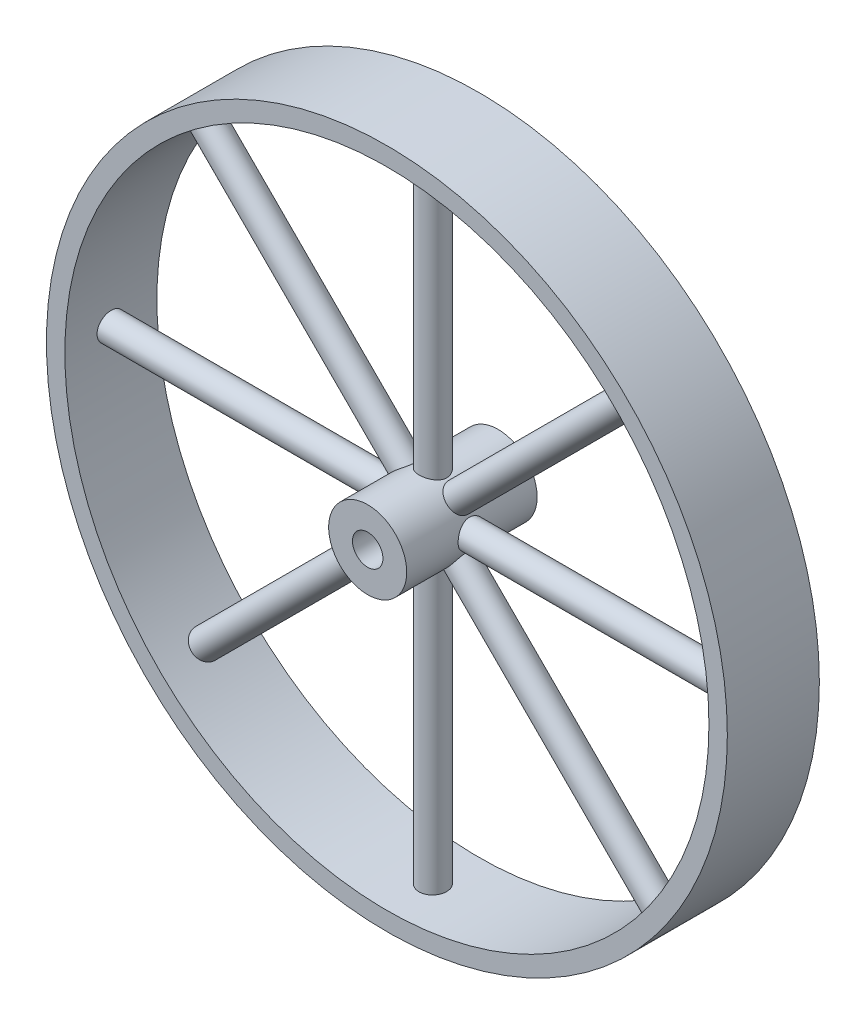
ISO-10303-21;
HEADER;
FILE_DESCRIPTION(('STEP AP214'),'2;1');
FILE_NAME('part.step','',(''),(''),'','','');
FILE_SCHEMA(('AUTOMOTIVE_DESIGN { 1 0 10303 214 1 1 1 1 }'));
ENDSEC;
DATA;
#1=APPLICATION_CONTEXT('core data for automotive mechanical design processes');
#2=APPLICATION_PROTOCOL_DEFINITION('international standard','automotive_design',2000,#1);
#3=PRODUCT_CONTEXT('',#1,'mechanical');
#4=PRODUCT('Part','Part','',(#3));
#5=PRODUCT_RELATED_PRODUCT_CATEGORY('part','',(#4));
#6=PRODUCT_DEFINITION_FORMATION('','',#4);
#7=PRODUCT_DEFINITION_CONTEXT('part definition',#1,'design');
#8=PRODUCT_DEFINITION('design','',#6,#7);
#9=PRODUCT_DEFINITION_SHAPE('','',#8);
#10=(LENGTH_UNIT() NAMED_UNIT(*) SI_UNIT(.MILLI.,.METRE.));
#11=(NAMED_UNIT(*) PLANE_ANGLE_UNIT() SI_UNIT($,.RADIAN.));
#12=(NAMED_UNIT(*) SI_UNIT($,.STERADIAN.) SOLID_ANGLE_UNIT());
#13=UNCERTAINTY_MEASURE_WITH_UNIT(LENGTH_MEASURE(1.E-05),#10,'distance_accuracy_value','');
#14=(GEOMETRIC_REPRESENTATION_CONTEXT(3) GLOBAL_UNCERTAINTY_ASSIGNED_CONTEXT((#13)) GLOBAL_UNIT_ASSIGNED_CONTEXT((#10,
#11,#12)) REPRESENTATION_CONTEXT('',''));
#15=CARTESIAN_POINT('',(0.,0.,0.));
#16=DIRECTION('',(0.,0.,1.));
#17=DIRECTION('',(1.,0.,0.));
#18=AXIS2_PLACEMENT_3D('',#15,#16,#17);
#19=CARTESIAN_POINT('',(0.,0.,6.35));
#20=DIRECTION('',(0.,0.,1.));
#21=DIRECTION('',(1.,0.,0.));
#22=AXIS2_PLACEMENT_3D('',#19,#20,#21);
#23=PLANE('',#22);
#24=CARTESIAN_POINT('',(0.,0.,6.35));
#25=DIRECTION('',(0.,0.,1.));
#26=DIRECTION('',(1.,0.,0.));
#27=AXIS2_PLACEMENT_3D('',#24,#25,#26);
#28=CIRCLE('',#27,46.99);
#29=CARTESIAN_POINT('',(46.99,0.,6.35));
#30=VERTEX_POINT('',#29);
#31=EDGE_CURVE('E205',#30,#30,#28,.T.);
#32=ORIENTED_EDGE('',*,*,#31,.T.);
#33=EDGE_LOOP('',(#32));
#34=FACE_BOUND('',#33,.T.);
#35=CARTESIAN_POINT('',(0.,0.,6.35));
#36=DIRECTION('',(0.,0.,1.));
#37=DIRECTION('',(1.,0.,0.));
#38=AXIS2_PLACEMENT_3D('',#35,#36,#37);
#39=CIRCLE('',#38,44.45);
#40=CARTESIAN_POINT('',(44.45,0.,6.35));
#41=VERTEX_POINT('',#40);
#42=EDGE_CURVE('E230',#41,#41,#39,.T.);
#43=ORIENTED_EDGE('',*,*,#42,.F.);
#44=EDGE_LOOP('',(#43));
#45=FACE_BOUND('',#44,.T.);
#46=ADVANCED_FACE('F51',(#34,#45),#23,.T.);
#47=CARTESIAN_POINT('',(0.,0.,-6.35));
#48=DIRECTION('',(0.,0.,1.));
#49=DIRECTION('',(1.,0.,0.));
#50=AXIS2_PLACEMENT_3D('',#47,#48,#49);
#51=PLANE('',#50);
#52=CARTESIAN_POINT('',(0.,0.,-6.35));
#53=DIRECTION('',(0.,0.,1.));
#54=DIRECTION('',(1.,0.,0.));
#55=AXIS2_PLACEMENT_3D('',#52,#53,#54);
#56=CIRCLE('',#55,46.99);
#57=CARTESIAN_POINT('',(46.99,0.,-6.35));
#58=VERTEX_POINT('',#57);
#59=EDGE_CURVE('E206',#58,#58,#56,.T.);
#60=ORIENTED_EDGE('',*,*,#59,.F.);
#61=EDGE_LOOP('',(#60));
#62=FACE_BOUND('',#61,.T.);
#63=CARTESIAN_POINT('',(0.,0.,-6.35));
#64=DIRECTION('',(0.,0.,1.));
#65=DIRECTION('',(1.,0.,0.));
#66=AXIS2_PLACEMENT_3D('',#63,#64,#65);
#67=CIRCLE('',#66,44.45);
#68=CARTESIAN_POINT('',(44.45,0.,-6.35));
#69=VERTEX_POINT('',#68);
#70=EDGE_CURVE('E226',#69,#69,#67,.T.);
#71=ORIENTED_EDGE('',*,*,#70,.T.);
#72=EDGE_LOOP('',(#71));
#73=FACE_BOUND('',#72,.T.);
#74=ADVANCED_FACE('F241',(#62,#73),#51,.F.);
#75=CARTESIAN_POINT('',(0.,0.,6.35));
#76=DIRECTION('',(0.,0.,-1.));
#77=DIRECTION('',(-1.,0.,0.));
#78=AXIS2_PLACEMENT_3D('',#75,#76,#77);
#79=CYLINDRICAL_SURFACE('',#78,46.99);
#80=ORIENTED_EDGE('',*,*,#31,.F.);
#81=EDGE_LOOP('',(#80));
#82=FACE_BOUND('',#81,.T.);
#83=ORIENTED_EDGE('',*,*,#59,.T.);
#84=EDGE_LOOP('',(#83));
#85=FACE_BOUND('',#84,.T.);
#86=ADVANCED_FACE('F53',(#82,#85),#79,.T.);
#87=CARTESIAN_POINT('',(0.,0.,6.35));
#88=DIRECTION('',(0.,0.,-1.));
#89=DIRECTION('',(-1.,0.,0.));
#90=AXIS2_PLACEMENT_3D('',#87,#88,#89);
#91=CYLINDRICAL_SURFACE('',#90,44.45);
#92=CARTESIAN_POINT('',(32.749056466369,-30.0549796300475,0.));
#93=CARTESIAN_POINT('',(32.7490535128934,-30.0549833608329,-0.106951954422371));
#94=CARTESIAN_POINT('',(32.7429424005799,-30.0616459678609,-0.213980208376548));
#95=CARTESIAN_POINT('',(32.718627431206,-30.08810777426,-0.425085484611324));
#96=CARTESIAN_POINT('',(32.7004092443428,-30.1079225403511,-0.529158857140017));
#97=CARTESIAN_POINT('',(32.6523341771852,-30.1600534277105,-0.731265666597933));
#98=CARTESIAN_POINT('',(32.622483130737,-30.1923632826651,-0.8293021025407));
#99=CARTESIAN_POINT('',(32.551894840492,-30.2684542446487,-1.01657816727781));
#100=CARTESIAN_POINT('',(32.5111602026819,-30.312232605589,-1.10581989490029));
#101=CARTESIAN_POINT('',(32.4197968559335,-30.4099282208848,-1.27307000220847));
#102=CARTESIAN_POINT('',(32.3691614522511,-30.4638523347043,-1.35107071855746));
#103=CARTESIAN_POINT('',(32.2593076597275,-30.5801562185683,-1.49355953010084));
#104=CARTESIAN_POINT('',(32.2000889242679,-30.6425363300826,-1.55804707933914));
#105=CARTESIAN_POINT('',(32.0745904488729,-30.7738750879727,-1.6716978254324));
#106=CARTESIAN_POINT('',(32.008308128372,-30.8428361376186,-1.72085539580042));
#107=CARTESIAN_POINT('',(31.8704678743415,-30.9852479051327,-1.80241456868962));
#108=CARTESIAN_POINT('',(31.7989099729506,-31.0586985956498,-1.83481627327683));
#109=CARTESIAN_POINT('',(31.652517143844,-31.2078766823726,-1.88192464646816));
#110=CARTESIAN_POINT('',(31.577684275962,-31.2836026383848,-1.89664227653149));
#111=CARTESIAN_POINT('',(31.4267893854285,-31.435184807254,-1.90799853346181));
#112=CARTESIAN_POINT('',(31.350727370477,-31.5110410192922,-1.90463727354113));
#113=CARTESIAN_POINT('',(31.1995947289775,-31.6606868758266,-1.87994030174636));
#114=CARTESIAN_POINT('',(31.1245234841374,-31.7344778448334,-1.85861639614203));
#115=CARTESIAN_POINT('',(30.9775045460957,-31.8780061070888,-1.79861773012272));
#116=CARTESIAN_POINT('',(30.9055568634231,-31.9477433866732,-1.75994291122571));
#117=CARTESIAN_POINT('',(30.7668930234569,-32.0813041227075,-1.66632675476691));
#118=CARTESIAN_POINT('',(30.7001786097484,-32.1451256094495,-1.61138002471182));
#119=CARTESIAN_POINT('',(30.5740172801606,-32.2651446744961,-1.48678373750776));
#120=CARTESIAN_POINT('',(30.5145704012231,-32.3213422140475,-1.41713410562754));
#121=CARTESIAN_POINT('',(30.404718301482,-32.4247021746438,-1.26504233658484));
#122=CARTESIAN_POINT('',(30.3543203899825,-32.4718572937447,-1.18258995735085));
#123=CARTESIAN_POINT('',(30.2641911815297,-32.5558756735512,-1.0072692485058));
#124=CARTESIAN_POINT('',(30.2244598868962,-32.5927389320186,-0.914400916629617));
#125=CARTESIAN_POINT('',(30.1569135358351,-32.6552475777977,-0.720878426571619));
#126=CARTESIAN_POINT('',(30.129098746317,-32.6808927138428,-0.620224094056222));
#127=CARTESIAN_POINT('',(30.0862716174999,-32.7203241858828,-0.413989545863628));
#128=CARTESIAN_POINT('',(30.0712592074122,-32.7341105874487,-0.308409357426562));
#129=CARTESIAN_POINT('',(30.0545241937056,-32.7494764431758,-0.0954100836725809));
#130=CARTESIAN_POINT('',(30.0527910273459,-32.751065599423,0.012007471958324));
#131=CARTESIAN_POINT('',(30.0626422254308,-32.7420232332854,0.225711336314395));
#132=CARTESIAN_POINT('',(30.0742265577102,-32.7313917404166,0.331997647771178));
#133=CARTESIAN_POINT('',(30.1103349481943,-32.6981776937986,0.540381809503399));
#134=CARTESIAN_POINT('',(30.1348541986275,-32.675599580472,0.642481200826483));
#135=CARTESIAN_POINT('',(30.1960497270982,-32.6190558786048,0.839640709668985));
#136=CARTESIAN_POINT('',(30.2327260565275,-32.5850902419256,0.934700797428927));
#137=CARTESIAN_POINT('',(30.3171074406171,-32.5065963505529,1.1151492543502));
#138=CARTESIAN_POINT('',(30.3648194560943,-32.4620614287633,1.20053146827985));
#139=CARTESIAN_POINT('',(30.4697733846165,-32.3635686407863,1.35913861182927));
#140=CARTESIAN_POINT('',(30.5270153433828,-32.3096107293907,1.43236348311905));
#141=CARTESIAN_POINT('',(30.6493105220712,-32.1936229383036,1.56462537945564));
#142=CARTESIAN_POINT('',(30.7143687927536,-32.1315878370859,1.62365315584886));
#143=CARTESIAN_POINT('',(30.8502951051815,-32.0011039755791,1.72578206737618));
#144=CARTESIAN_POINT('',(30.9211631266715,-31.9326552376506,1.7688832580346));
#145=CARTESIAN_POINT('',(31.0665703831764,-31.791209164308,1.83791930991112));
#146=CARTESIAN_POINT('',(31.1411083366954,-31.7182134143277,1.86386011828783));
#147=CARTESIAN_POINT('',(31.2916953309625,-31.5696608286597,1.89785852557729));
#148=CARTESIAN_POINT('',(31.3677443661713,-31.4941040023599,1.9059161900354));
#149=CARTESIAN_POINT('',(31.5191089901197,-31.3426183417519,1.90391890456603));
#150=CARTESIAN_POINT('',(31.5944251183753,-31.2666898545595,1.89387848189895));
#151=CARTESIAN_POINT('',(31.7422734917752,-31.116582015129,1.8560000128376));
#152=CARTESIAN_POINT('',(31.8148057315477,-31.0424026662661,1.8281619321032));
#153=CARTESIAN_POINT('',(31.9550993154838,-30.8979655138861,1.7554811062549));
#154=CARTESIAN_POINT('',(32.0228606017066,-30.8277077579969,1.71063815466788));
#155=CARTESIAN_POINT('',(32.1517958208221,-30.6932112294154,1.60522354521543));
#156=CARTESIAN_POINT('',(32.2129699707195,-30.6289722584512,1.54465240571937));
#157=CARTESIAN_POINT('',(32.3271725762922,-30.5084140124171,1.40945065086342));
#158=CARTESIAN_POINT('',(32.3801953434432,-30.4521002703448,1.33481029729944));
#159=CARTESIAN_POINT('',(32.476693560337,-30.3491658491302,1.17358797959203));
#160=CARTESIAN_POINT('',(32.5201666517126,-30.3025475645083,1.0870030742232));
#161=CARTESIAN_POINT('',(32.5964788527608,-30.2204437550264,0.904295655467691));
#162=CARTESIAN_POINT('',(32.6293091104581,-30.1849674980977,0.808165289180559));
#163=CARTESIAN_POINT('',(32.6834340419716,-30.1263546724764,0.609224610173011));
#164=CARTESIAN_POINT('',(32.7047423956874,-30.1032034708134,0.50642238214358));
#165=CARTESIAN_POINT('',(32.7296854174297,-30.0760765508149,0.335814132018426));
#166=CARTESIAN_POINT('',(32.7369413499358,-30.0681762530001,0.2691141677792));
#167=CARTESIAN_POINT('',(32.7466278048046,-30.0576266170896,0.134952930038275));
#168=CARTESIAN_POINT('',(32.7490583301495,-30.0549772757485,0.0674916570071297));
#169=CARTESIAN_POINT('',(32.749056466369,-30.0549796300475,0.));
#170=B_SPLINE_CURVE_WITH_KNOTS('',3,(#92,#93,#94,#95,#96,#97,#98,#99,#100,#101,#102,#103,#104,
#105,#106,#107,#108,#109,#110,#111,#112,#113,#114,#115,#116,#117,#118,#119,#120,#121,#122,#123,
#124,#125,#126,#127,#128,#129,#130,#131,#132,#133,#134,#135,#136,#137,#138,#139,#140,#141,#142,
#143,#144,#145,#146,#147,#148,#149,#150,#151,#152,#153,#154,#155,#156,#157,#158,#159,#160,#161,
#162,#163,#164,#165,#166,#167,#168,#169),.UNSPECIFIED.,.T.,.F.,(4,2,2,2,2,2,2,2,2,2,2,2,2,2,2,2,
2,2,2,2,2,2,2,2,2,2,2,2,2,2,2,2,2,2,2,2,2,2,4),(0.,0.320609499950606,0.641599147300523,
0.962428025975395,1.2831801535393,1.60414992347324,1.92513265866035,2.24623306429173,
2.5673315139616,2.88823082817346,3.20912813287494,3.52981468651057,3.8505023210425,
4.17129635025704,4.49209201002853,4.81314563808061,5.13419933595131,5.45526022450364,
5.77631933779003,6.09712304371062,6.41792597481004,6.73860975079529,7.05929488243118,
7.38018284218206,7.70107234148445,8.02217032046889,8.34326718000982,8.66425270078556,
8.98523704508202,9.30596385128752,9.62669127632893,9.94742259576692,10.2681433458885,
10.5890869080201,10.9101096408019,11.2313986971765,11.5523054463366,11.7546250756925,
11.9569445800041),.UNSPECIFIED.);
#171=CARTESIAN_POINT('',(32.749056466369,-30.0549796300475,0.));
#172=VERTEX_POINT('',#171);
#173=EDGE_CURVE('E11',#172,#172,#170,.T.);
#174=ORIENTED_EDGE('',*,*,#173,.F.);
#175=EDGE_LOOP('',(#174));
#176=FACE_BOUND('',#175,.T.);
#177=CARTESIAN_POINT('',(1.90500000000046,-44.4091598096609,0.));
#178=CARTESIAN_POINT('',(1.90499527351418,-44.4091603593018,-0.106951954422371));
#179=CARTESIAN_POINT('',(1.89596288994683,-44.4095503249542,-0.213980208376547));
#180=CARTESIAN_POINT('',(1.86005828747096,-44.4110683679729,-0.425085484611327));
#181=CARTESIAN_POINT('',(1.83316492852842,-44.4121973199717,-0.529158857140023));
#182=CARTESIAN_POINT('',(1.76230861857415,-44.4150652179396,-0.731265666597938));
#183=CARTESIAN_POINT('',(1.71835422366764,-44.4168038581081,-0.829302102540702));
#184=CARTESIAN_POINT('',(1.61463632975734,-44.4206948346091,-1.01657816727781));
#185=CARTESIAN_POINT('',(1.55487661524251,-44.4228470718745,-1.10581989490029));
#186=CARTESIAN_POINT('',(1.42119174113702,-44.4273246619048,-1.27307000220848));
#187=CARTESIAN_POINT('',(1.3472569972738,-44.429650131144,-1.35107071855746));
#188=CARTESIAN_POINT('',(1.18733937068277,-44.4342110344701,-1.49355953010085));
#189=CARTESIAN_POINT('',(1.10135600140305,-44.4364464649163,-1.55804707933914));
#190=CARTESIAN_POINT('',(0.919744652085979,-44.4405761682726,-1.67169782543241));
#191=CARTESIAN_POINT('',(0.824113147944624,-44.4424703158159,-1.72085539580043));
#192=CARTESIAN_POINT('',(0.62594504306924,-44.4457028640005,-1.80241456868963));
#193=CARTESIAN_POINT('',(0.523408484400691,-44.447041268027,-1.83481627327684));
#194=CARTESIAN_POINT('',(0.314408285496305,-44.4490107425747,-1.88192464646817));
#195=CARTESIAN_POINT('',(0.207947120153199,-44.4496422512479,-1.89664227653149));
#196=CARTESIAN_POINT('',(-0.00593645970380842,-44.4501282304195,-1.90799853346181));
#197=CARTESIAN_POINT('',(-0.113358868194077,-44.4499827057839,-1.90463727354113));
#198=CARTESIAN_POINT('',(-0.32604138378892,-44.4489313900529,-1.87994030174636));
#199=CARTESIAN_POINT('',(-0.431302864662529,-44.4480260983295,-1.85861639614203));
#200=CARTESIAN_POINT('',(-0.636750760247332,-44.44555781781,-1.79861773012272));
#201=CARTESIAN_POINT('',(-0.736937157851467,-44.4439948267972,-1.75994291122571));
#202=CARTESIAN_POINT('',(-0.929429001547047,-44.4403863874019,-1.66632675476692));
#203=CARTESIAN_POINT('',(-1.02173182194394,-44.4383407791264,-1.61138002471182));
#204=CARTESIAN_POINT('',(-1.19580764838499,-44.4339975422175,-1.48678373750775));
#205=CARTESIAN_POINT('',(-1.277580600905,-44.4316999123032,-1.41713410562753));
#206=CARTESIAN_POINT('',(-1.42834429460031,-44.4271092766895,-1.26504233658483));
#207=CARTESIAN_POINT('',(-1.49732470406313,-44.4248162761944,-1.18258995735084));
#208=CARTESIAN_POINT('',(-1.62046564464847,-44.42049526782,-1.00726924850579));
#209=CARTESIAN_POINT('',(-1.67462617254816,-44.4184672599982,-0.914400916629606));
#210=CARTESIAN_POINT('',(-1.76658894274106,-44.4149050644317,-0.720878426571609));
#211=CARTESIAN_POINT('',(-1.80439081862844,-44.4133708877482,-0.620224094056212));
#212=CARTESIAN_POINT('',(-1.86255643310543,-44.4109697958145,-0.413989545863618));
#213=CARTESIAN_POINT('',(-1.88292026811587,-44.4101028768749,-0.308409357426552));
#214=CARTESIAN_POINT('',(-1.90561901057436,-44.4091347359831,-0.095410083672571));
#215=CARTESIAN_POINT('',(-1.90796824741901,-44.409032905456,0.0120074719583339));
#216=CARTESIAN_POINT('',(-1.89460848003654,-44.4096048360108,0.225711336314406));
#217=CARTESIAN_POINT('',(-1.87889951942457,-44.4102785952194,0.331997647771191));
#218=CARTESIAN_POINT('',(-1.82988115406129,-44.4123252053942,0.540381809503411));
#219=CARTESIAN_POINT('',(-1.7965782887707,-44.4136977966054,0.642481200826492));
#220=CARTESIAN_POINT('',(-1.71332408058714,-44.4169871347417,0.839640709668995));
#221=CARTESIAN_POINT('',(-1.66337266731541,-44.418903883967,0.934700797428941));
#222=CARTESIAN_POINT('',(-1.54820245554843,-44.4230669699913,1.11514925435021));
#223=CARTESIAN_POINT('',(-1.4829740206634,-44.4253135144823,1.20053146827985));
#224=CARTESIAN_POINT('',(-1.33911546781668,-44.429882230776,1.35913861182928));
#225=CARTESIAN_POINT('',(-1.2604852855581,-44.4322044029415,1.43236348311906));
#226=CARTESIAN_POINT('',(-1.09199378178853,-44.436664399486,1.56462537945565));
#227=CARTESIAN_POINT('',(-1.00212519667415,-44.4388021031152,1.62365315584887));
#228=CARTESIAN_POINT('',(-0.813744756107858,-44.4426504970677,1.72578206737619));
#229=CARTESIAN_POINT('',(-0.715232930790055,-44.4443611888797,1.7688832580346));
#230=CARTESIAN_POINT('',(-0.512396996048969,-44.4471621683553,1.83791930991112));
#231=CARTESIAN_POINT('',(-0.408074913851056,-44.4482526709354,1.86386011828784));
#232=CARTESIAN_POINT('',(-0.196551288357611,-44.4496912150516,1.89785852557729));
#233=CARTESIAN_POINT('',(-0.0893497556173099,-44.4500392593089,1.9059161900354));
#234=CARTESIAN_POINT('',(0.124797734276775,-44.4499536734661,1.90391890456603));
#235=CARTESIAN_POINT('',(0.231743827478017,-44.4495206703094,1.89387848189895));
#236=CARTESIAN_POINT('',(0.442430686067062,-44.4479229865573,1.85600001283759));
#237=CARTESIAN_POINT('',(0.546171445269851,-44.4467583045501,1.8281619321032));
#238=CARTESIAN_POINT('',(0.747506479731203,-44.4438283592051,1.75548110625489));
#239=CARTESIAN_POINT('',(0.845100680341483,-44.442063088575,1.71063815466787));
#240=CARTESIAN_POINT('',(1.03137505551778,-44.4381306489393,1.60522354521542));
#241=CARTESIAN_POINT('',(1.12005552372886,-44.4359634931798,1.54465240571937));
#242=CARTESIAN_POINT('',(1.28605651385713,-44.4314693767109,1.40945065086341));
#243=CARTESIAN_POINT('',(1.36336910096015,-44.4291423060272,1.33481029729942));
#244=CARTESIAN_POINT('',(1.50438927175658,-44.424591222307,1.17358797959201));
#245=CARTESIAN_POINT('',(1.56809349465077,-44.4223672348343,1.08700307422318));
#246=CARTESIAN_POINT('',(1.68011052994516,-44.4182719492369,0.904295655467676));
#247=CARTESIAN_POINT('',(1.72841052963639,-44.4164009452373,0.808165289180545));
#248=CARTESIAN_POINT('',(1.80812816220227,-44.4132275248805,0.609224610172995));
#249=CARTESIAN_POINT('',(1.83956581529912,-44.4119244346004,0.506422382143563));
#250=CARTESIAN_POINT('',(1.87638482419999,-44.4103801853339,0.33581413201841));
#251=CARTESIAN_POINT('',(1.88710189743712,-44.4099245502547,0.269114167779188));
#252=CARTESIAN_POINT('',(1.90141097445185,-44.4093141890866,0.134952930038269));
#253=CARTESIAN_POINT('',(1.90500298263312,-44.4091594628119,0.0674916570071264));
#254=CARTESIAN_POINT('',(1.90500000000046,-44.4091598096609,0.));
#255=B_SPLINE_CURVE_WITH_KNOTS('',3,(#177,#178,#179,#180,#181,#182,#183,#184,#185,#186,#187,
#188,#189,#190,#191,#192,#193,#194,#195,#196,#197,#198,#199,#200,#201,#202,#203,#204,#205,#206,
#207,#208,#209,#210,#211,#212,#213,#214,#215,#216,#217,#218,#219,#220,#221,#222,#223,#224,#225,
#226,#227,#228,#229,#230,#231,#232,#233,#234,#235,#236,#237,#238,#239,#240,#241,#242,#243,#244,
#245,#246,#247,#248,#249,#250,#251,#252,#253,#254),.UNSPECIFIED.,.T.,.F.,(4,2,2,2,2,2,2,2,2,2,2,
2,2,2,2,2,2,2,2,2,2,2,2,2,2,2,2,2,2,2,2,2,2,2,2,2,2,2,4),(0.,0.320609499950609,
0.641599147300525,0.9624280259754,1.28318015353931,1.60414992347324,1.92513265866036,
2.24623306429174,2.56733151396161,2.88823082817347,3.20912813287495,3.52981468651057,
3.8505023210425,4.17129635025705,4.49209201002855,4.81314563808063,5.13419933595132,
5.45526022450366,5.77631933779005,6.09712304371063,6.41792597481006,6.73860975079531,
7.0592948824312,7.38018284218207,7.70107234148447,8.02217032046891,8.34326718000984,
8.66425270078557,8.98523704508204,9.30596385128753,9.62669127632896,9.94742259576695,
10.2681433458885,10.5890869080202,10.910109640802,11.2313986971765,11.5523054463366,
11.7546250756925,11.9569445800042),.UNSPECIFIED.);
#256=CARTESIAN_POINT('',(1.90500000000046,-44.4091598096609,0.));
#257=VERTEX_POINT('',#256);
#258=EDGE_CURVE('E63',#257,#257,#255,.T.);
#259=ORIENTED_EDGE('',*,*,#258,.F.);
#260=EDGE_LOOP('',(#259));
#261=FACE_BOUND('',#260,.T.);
#262=CARTESIAN_POINT('',(-30.0549796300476,-32.7490564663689,0.));
#263=CARTESIAN_POINT('',(-30.054983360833,-32.7490535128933,-0.106951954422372));
#264=CARTESIAN_POINT('',(-30.061645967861,-32.7429424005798,-0.213980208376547));
#265=CARTESIAN_POINT('',(-30.0881077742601,-32.7186274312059,-0.425085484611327));
#266=CARTESIAN_POINT('',(-30.1079225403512,-32.7004092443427,-0.529158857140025));
#267=CARTESIAN_POINT('',(-30.1600534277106,-32.6523341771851,-0.731265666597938));
#268=CARTESIAN_POINT('',(-30.1923632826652,-32.6224831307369,-0.829302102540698));
#269=CARTESIAN_POINT('',(-30.2684542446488,-32.5518948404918,-1.01657816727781));
#270=CARTESIAN_POINT('',(-30.3122326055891,-32.5111602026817,-1.10581989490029));
#271=CARTESIAN_POINT('',(-30.409928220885,-32.4197968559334,-1.27307000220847));
#272=CARTESIAN_POINT('',(-30.4638523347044,-32.369161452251,-1.35107071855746));
#273=CARTESIAN_POINT('',(-30.5801562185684,-32.2593076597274,-1.49355953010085));
#274=CARTESIAN_POINT('',(-30.6425363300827,-32.2000889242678,-1.55804707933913));
#275=CARTESIAN_POINT('',(-30.7738750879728,-32.0745904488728,-1.6716978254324));
#276=CARTESIAN_POINT('',(-30.8428361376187,-32.0083081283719,-1.72085539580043));
#277=CARTESIAN_POINT('',(-30.9852479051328,-31.8704678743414,-1.80241456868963));
#278=CARTESIAN_POINT('',(-31.05869859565,-31.7989099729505,-1.83481627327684));
#279=CARTESIAN_POINT('',(-31.2078766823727,-31.6525171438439,-1.88192464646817));
#280=CARTESIAN_POINT('',(-31.2836026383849,-31.5776842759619,-1.8966422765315));
#281=CARTESIAN_POINT('',(-31.4351848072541,-31.4267893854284,-1.90799853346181));
#282=CARTESIAN_POINT('',(-31.5110410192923,-31.3507273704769,-1.90463727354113));
#283=CARTESIAN_POINT('',(-31.6606868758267,-31.1995947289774,-1.87994030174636));
#284=CARTESIAN_POINT('',(-31.7344778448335,-31.1245234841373,-1.85861639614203));
#285=CARTESIAN_POINT('',(-31.8780061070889,-30.9775045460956,-1.79861773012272));
#286=CARTESIAN_POINT('',(-31.9477433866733,-30.905556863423,-1.75994291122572));
#287=CARTESIAN_POINT('',(-32.0813041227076,-30.7668930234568,-1.66632675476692));
#288=CARTESIAN_POINT('',(-32.1451256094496,-30.7001786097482,-1.61138002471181));
#289=CARTESIAN_POINT('',(-32.2651446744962,-30.5740172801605,-1.48678373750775));
#290=CARTESIAN_POINT('',(-32.3213422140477,-30.5145704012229,-1.41713410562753));
#291=CARTESIAN_POINT('',(-32.424702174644,-30.4047183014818,-1.26504233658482));
#292=CARTESIAN_POINT('',(-32.4718572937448,-30.3543203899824,-1.18258995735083));
#293=CARTESIAN_POINT('',(-32.5558756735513,-30.2641911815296,-1.00726924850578));
#294=CARTESIAN_POINT('',(-32.5927389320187,-30.224459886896,-0.914400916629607));
#295=CARTESIAN_POINT('',(-32.6552475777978,-30.156913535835,-0.720878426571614));
#296=CARTESIAN_POINT('',(-32.6808927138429,-30.1290987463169,-0.620224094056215));
#297=CARTESIAN_POINT('',(-32.7203241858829,-30.0862716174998,-0.413989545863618));
#298=CARTESIAN_POINT('',(-32.7341105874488,-30.0712592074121,-0.308409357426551));
#299=CARTESIAN_POINT('',(-32.7494764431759,-30.0545241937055,-0.0954100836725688));
#300=CARTESIAN_POINT('',(-32.7510655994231,-30.0527910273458,0.0120074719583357));
#301=CARTESIAN_POINT('',(-32.7420232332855,-30.0626422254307,0.225711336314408));
#302=CARTESIAN_POINT('',(-32.7313917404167,-30.0742265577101,0.331997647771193));
#303=CARTESIAN_POINT('',(-32.6981776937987,-30.1103349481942,0.540381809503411));
#304=CARTESIAN_POINT('',(-32.6755995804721,-30.1348541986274,0.642481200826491));
#305=CARTESIAN_POINT('',(-32.6190558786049,-30.196049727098,0.839640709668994));
#306=CARTESIAN_POINT('',(-32.5850902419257,-30.2327260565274,0.934700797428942));
#307=CARTESIAN_POINT('',(-32.506596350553,-30.317107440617,1.11514925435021));
#308=CARTESIAN_POINT('',(-32.4620614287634,-30.3648194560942,1.20053146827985));
#309=CARTESIAN_POINT('',(-32.3635686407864,-30.4697733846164,1.35913861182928));
#310=CARTESIAN_POINT('',(-32.3096107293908,-30.5270153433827,1.43236348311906));
#311=CARTESIAN_POINT('',(-32.1936229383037,-30.6493105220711,1.56462537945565));
#312=CARTESIAN_POINT('',(-32.131587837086,-30.7143687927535,1.62365315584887));
#313=CARTESIAN_POINT('',(-32.0011039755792,-30.8502951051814,1.72578206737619));
#314=CARTESIAN_POINT('',(-31.9326552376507,-30.9211631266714,1.7688832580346));
#315=CARTESIAN_POINT('',(-31.7912091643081,-31.0665703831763,1.83791930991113));
#316=CARTESIAN_POINT('',(-31.7182134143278,-31.1411083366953,1.86386011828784));
#317=CARTESIAN_POINT('',(-31.5696608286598,-31.2916953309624,1.89785852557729));
#318=CARTESIAN_POINT('',(-31.49410400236,-31.3677443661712,1.9059161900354));
#319=CARTESIAN_POINT('',(-31.342618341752,-31.5191089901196,1.90391890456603));
#320=CARTESIAN_POINT('',(-31.2666898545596,-31.5944251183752,1.89387848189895));
#321=CARTESIAN_POINT('',(-31.1165820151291,-31.7422734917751,1.8560000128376));
#322=CARTESIAN_POINT('',(-31.0424026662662,-31.8148057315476,1.8281619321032));
#323=CARTESIAN_POINT('',(-30.8979655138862,-31.9550993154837,1.75548110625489));
#324=CARTESIAN_POINT('',(-30.827707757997,-32.0228606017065,1.71063815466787));
#325=CARTESIAN_POINT('',(-30.6932112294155,-32.151795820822,1.60522354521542));
#326=CARTESIAN_POINT('',(-30.6289722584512,-32.2129699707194,1.54465240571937));
#327=CARTESIAN_POINT('',(-30.5084140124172,-32.3271725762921,1.40945065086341));
#328=CARTESIAN_POINT('',(-30.4521002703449,-32.3801953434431,1.33481029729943));
#329=CARTESIAN_POINT('',(-30.3491658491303,-32.476693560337,1.173587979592));
#330=CARTESIAN_POINT('',(-30.3025475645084,-32.5201666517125,1.08700307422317));
#331=CARTESIAN_POINT('',(-30.2204437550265,-32.5964788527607,0.904295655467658));
#332=CARTESIAN_POINT('',(-30.1849674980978,-32.629309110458,0.808165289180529));
#333=CARTESIAN_POINT('',(-30.1263546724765,-32.6834340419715,0.609224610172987));
#334=CARTESIAN_POINT('',(-30.1032034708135,-32.7047423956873,0.50642238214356));
#335=CARTESIAN_POINT('',(-30.076076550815,-32.7296854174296,0.33581413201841));
#336=CARTESIAN_POINT('',(-30.0681762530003,-32.7369413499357,0.269114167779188));
#337=CARTESIAN_POINT('',(-30.0576266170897,-32.7466278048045,0.134952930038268));
#338=CARTESIAN_POINT('',(-30.0549772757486,-32.7490583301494,0.067491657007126));
#339=CARTESIAN_POINT('',(-30.0549796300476,-32.7490564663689,0.));
#340=B_SPLINE_CURVE_WITH_KNOTS('',3,(#262,#263,#264,#265,#266,#267,#268,#269,#270,#271,#272,
#273,#274,#275,#276,#277,#278,#279,#280,#281,#282,#283,#284,#285,#286,#287,#288,#289,#290,#291,
#292,#293,#294,#295,#296,#297,#298,#299,#300,#301,#302,#303,#304,#305,#306,#307,#308,#309,#310,
#311,#312,#313,#314,#315,#316,#317,#318,#319,#320,#321,#322,#323,#324,#325,#326,#327,#328,#329,
#330,#331,#332,#333,#334,#335,#336,#337,#338,#339),.UNSPECIFIED.,.T.,.F.,(4,2,2,2,2,2,2,2,2,2,2,
2,2,2,2,2,2,2,2,2,2,2,2,2,2,2,2,2,2,2,2,2,2,2,2,2,2,2,4),(0.,0.320609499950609,
0.641599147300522,0.962428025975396,1.28318015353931,1.60414992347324,1.92513265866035,
2.24623306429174,2.56733151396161,2.88823082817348,3.20912813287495,3.52981468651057,
3.85050232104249,4.17129635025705,4.49209201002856,4.81314563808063,5.13419933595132,
5.45526022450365,5.77631933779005,6.09712304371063,6.41792597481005,6.7386097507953,
7.05929488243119,7.38018284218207,7.70107234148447,8.02217032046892,8.34326718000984,
8.66425270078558,8.98523704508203,9.30596385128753,9.62669127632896,9.94742259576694,
10.2681433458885,10.5890869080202,10.910109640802,11.2313986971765,11.5523054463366,
11.7546250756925,11.9569445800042),.UNSPECIFIED.);
#341=CARTESIAN_POINT('',(-30.0549796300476,-32.7490564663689,0.));
#342=VERTEX_POINT('',#341);
#343=EDGE_CURVE('E67',#342,#342,#340,.T.);
#344=ORIENTED_EDGE('',*,*,#343,.F.);
#345=EDGE_LOOP('',(#344));
#346=FACE_BOUND('',#345,.T.);
#347=CARTESIAN_POINT('',(-44.45,0.,1.905));
#348=CARTESIAN_POINT('',(-44.4499994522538,-0.106952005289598,1.90499527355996));
#349=CARTESIAN_POINT('',(-44.4496098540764,-0.213980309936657,1.8959628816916));
#350=CARTESIAN_POINT('',(-44.4480931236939,-0.425085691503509,1.86005824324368));
#351=CARTESIAN_POINT('',(-44.4469651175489,-0.529159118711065,1.83316485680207));
#352=CARTESIAN_POINT('',(-44.4440992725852,-0.731266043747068,1.76230846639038));
#353=CARTESIAN_POINT('',(-44.4423617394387,-0.829302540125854,1.71835401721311));
#354=CARTESIAN_POINT('',(-44.4384726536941,-1.01657870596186,1.61463599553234));
#355=CARTESIAN_POINT('',(-44.4363212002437,-1.10582047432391,1.55487620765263));
#356=CARTESIAN_POINT('',(-44.4318445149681,-1.27307053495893,1.42119125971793));
#357=CARTESIAN_POINT('',(-44.4295191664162,-1.35107117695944,1.34725653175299));
#358=CARTESIAN_POINT('',(-44.4249577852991,-1.49355984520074,1.18733896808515));
#359=CARTESIAN_POINT('',(-44.4227217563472,-1.55804732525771,1.10135564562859));
#360=CARTESIAN_POINT('',(-44.4185903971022,-1.67169799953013,0.919744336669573));
#361=CARTESIAN_POINT('',(-44.4166951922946,-1.72085555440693,0.824112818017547));
#362=CARTESIAN_POINT('',(-44.4134605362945,-1.80241469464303,0.625944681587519));
#363=CARTESIAN_POINT('',(-44.4121210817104,-1.83481638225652,0.523408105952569));
#364=CARTESIAN_POINT('',(-44.4101499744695,-1.88192471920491,0.314407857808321));
#365=CARTESIAN_POINT('',(-44.4095178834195,-1.8966423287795,0.207946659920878));
#366=CARTESIAN_POINT('',(-44.4090314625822,-1.90799853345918,-0.00593698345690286));
#367=CARTESIAN_POINT('',(-44.4091771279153,-1.90463724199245,-0.113359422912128));
#368=CARTESIAN_POINT('',(-44.410229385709,-1.87994022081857,-0.326041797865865));
#369=CARTESIAN_POINT('',(-44.4111354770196,-1.858616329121,-0.431303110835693));
#370=CARTESIAN_POINT('',(-44.4136056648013,-1.79861774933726,-0.636750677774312));
#371=CARTESIAN_POINT('',(-44.415169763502,-1.7599430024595,-0.736936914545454));
#372=CARTESIAN_POINT('',(-44.4187802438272,-1.66632699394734,-0.929428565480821));
#373=CARTESIAN_POINT('',(-44.4208267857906,-1.61138032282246,-1.02173134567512));
#374=CARTESIAN_POINT('',(-44.4251713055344,-1.48678416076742,-1.19580711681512));
#375=CARTESIAN_POINT('',(-44.427469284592,-1.41713459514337,-1.27758005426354));
#376=CARTESIAN_POINT('',(-44.432059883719,-1.26504287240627,-1.42834382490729));
#377=CARTESIAN_POINT('',(-44.4343524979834,-1.18259045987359,-1.4973243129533));
#378=CARTESIAN_POINT('',(-44.4386721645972,-1.00726965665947,-1.62046539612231));
#379=CARTESIAN_POINT('',(-44.4406992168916,-0.914401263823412,-1.67462598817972));
#380=CARTESIAN_POINT('',(-44.4442593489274,-0.72087875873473,-1.76658880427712));
#381=CARTESIAN_POINT('',(-44.4457924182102,-0.620224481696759,-1.80439068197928));
#382=CARTESIAN_POINT('',(-44.4481916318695,-0.413990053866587,-1.86255631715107));
#383=CARTESIAN_POINT('',(-44.449057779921,-0.308409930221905,-1.88292017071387));
#384=CARTESIAN_POINT('',(-44.4500250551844,-0.095410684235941,-1.90561898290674));
#385=CARTESIAN_POINT('',(-44.4501267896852,0.0120069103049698,-1.90796825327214));
#386=CARTESIAN_POINT('',(-44.4495553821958,0.225710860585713,-1.89460853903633));
#387=CARTESIAN_POINT('',(-44.4488822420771,0.331997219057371,-1.87889959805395));
#388=CARTESIAN_POINT('',(-44.4468373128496,0.540381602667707,-1.82988122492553));
#389=CARTESIAN_POINT('',(-44.4454657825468,0.642481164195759,-1.79657831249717));
#390=CARTESIAN_POINT('',(-44.4421785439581,0.83964099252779,-1.71332395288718));
#391=CARTESIAN_POINT('',(-44.4402628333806,0.9347012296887,-1.66337243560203));
#392=CARTESIAN_POINT('',(-44.4361013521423,1.11514978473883,-1.54820207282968));
#393=CARTESIAN_POINT('',(-44.4338553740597,1.20053196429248,-1.4829736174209));
#394=CARTESIAN_POINT('',(-44.429287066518,1.35913902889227,-1.33911504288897));
#395=CARTESIAN_POINT('',(-44.4269647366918,1.43236385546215,-1.26048485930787));
#396=CARTESIAN_POINT('',(-44.4225037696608,1.56462566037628,-1.09199337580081));
#397=CARTESIAN_POINT('',(-44.4203652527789,1.62365339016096,-1.00212481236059));
#398=CARTESIAN_POINT('',(-44.4165149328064,1.72578221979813,-0.813744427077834));
#399=CARTESIAN_POINT('',(-44.4148031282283,1.76888337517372,-0.715232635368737));
#400=CARTESIAN_POINT('',(-44.412000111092,1.83791940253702,-0.512396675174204));
#401=CARTESIAN_POINT('',(-44.4109086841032,1.86386020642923,-0.408074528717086));
#402=CARTESIAN_POINT('',(-44.4094688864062,1.89785858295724,-0.196550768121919));
#403=CARTESIAN_POINT('',(-44.4091205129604,1.90591622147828,-0.0893491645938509));
#404=CARTESIAN_POINT('',(-44.4092061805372,1.90391886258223,0.124798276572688));
#405=CARTESIAN_POINT('',(-44.4096395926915,1.89387842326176,0.231744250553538));
#406=CARTESIAN_POINT('',(-44.4112386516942,1.85599996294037,0.442430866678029));
#407=CARTESIAN_POINT('',(-44.4124042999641,1.82816190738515,0.546171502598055));
#408=CARTESIAN_POINT('',(-44.4153363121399,1.75548117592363,0.747506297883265));
#409=CARTESIAN_POINT('',(-44.4171026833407,1.71063829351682,0.845100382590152));
#410=CARTESIAN_POINT('',(-44.4210369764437,1.60522385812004,1.03137455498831));
#411=CARTESIAN_POINT('',(-44.4232048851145,1.54465282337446,1.12005493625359));
#412=CARTESIAN_POINT('',(-44.4276998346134,1.40945118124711,1.28605593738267));
#413=CARTESIAN_POINT('',(-44.4300269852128,1.33481081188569,1.36336860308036));
#414=CARTESIAN_POINT('',(-44.4345775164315,1.17358843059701,1.50438892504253));
#415=CARTESIAN_POINT('',(-44.4368008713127,1.08700347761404,1.56809322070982));
#416=CARTESIAN_POINT('',(-44.4408944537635,0.904296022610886,1.68011033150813));
#417=CARTESIAN_POINT('',(-44.4427643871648,0.808165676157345,1.72841034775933));
#418=CARTESIAN_POINT('',(-44.4459357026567,0.609225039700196,1.80812801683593));
#419=CARTESIAN_POINT('',(-44.4472377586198,0.506422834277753,1.83956568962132));
#420=CARTESIAN_POINT('',(-44.4487807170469,0.335814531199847,1.87638475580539));
#421=CARTESIAN_POINT('',(-44.4492359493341,0.269114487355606,1.8871018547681));
#422=CARTESIAN_POINT('',(-44.4498457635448,0.134953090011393,1.90141096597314));
#423=CARTESIAN_POINT('',(-44.4500003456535,0.067491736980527,1.90500298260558));
#424=CARTESIAN_POINT('',(-44.45,0.,1.905));
#425=B_SPLINE_CURVE_WITH_KNOTS('',3,(#347,#348,#349,#350,#351,#352,#353,#354,#355,#356,#357,
#358,#359,#360,#361,#362,#363,#364,#365,#366,#367,#368,#369,#370,#371,#372,#373,#374,#375,#376,
#377,#378,#379,#380,#381,#382,#383,#384,#385,#386,#387,#388,#389,#390,#391,#392,#393,#394,#395,
#396,#397,#398,#399,#400,#401,#402,#403,#404,#405,#406,#407,#408,#409,#410,#411,#412,#413,#414,
#415,#416,#417,#418,#419,#420,#421,#422,#423,#424),.UNSPECIFIED.,.T.,.F.,(4,2,2,2,2,2,2,2,2,2,2,
2,2,2,2,2,2,2,2,2,2,2,2,2,2,2,2,2,2,2,2,2,2,2,2,2,2,2,4),(0.,0.32060965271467,0.641599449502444,
0.962428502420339,1.28318080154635,1.60415037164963,1.92513291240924,2.24623339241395,
2.56733191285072,2.88823131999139,3.20912871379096,3.52981478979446,3.85050195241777,
4.17129584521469,4.4920913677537,4.81314519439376,5.13419908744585,5.45525977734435,
5.77631869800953,6.09712252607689,6.41792557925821,6.73860983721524,7.0592954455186,
7.38018332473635,7.70107274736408,8.02217064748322,8.34326742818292,8.66425315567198,
8.98523770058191,9.30596416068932,9.62669124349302,9.94742222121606,10.2681426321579,
10.5890863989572,10.9101093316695,11.2313983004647,11.5523049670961,11.7546248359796,
11.9569445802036),.UNSPECIFIED.);
#426=CARTESIAN_POINT('',(-44.45,0.,1.905));
#427=VERTEX_POINT('',#426);
#428=EDGE_CURVE('E71',#427,#427,#425,.T.);
#429=ORIENTED_EDGE('',*,*,#428,.F.);
#430=EDGE_LOOP('',(#429));
#431=FACE_BOUND('',#430,.T.);
#432=CARTESIAN_POINT('',(-32.7490564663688,30.0549796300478,0.));
#433=CARTESIAN_POINT('',(-32.7490535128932,30.0549833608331,-0.106951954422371));
#434=CARTESIAN_POINT('',(-32.7429424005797,30.0616459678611,-0.213980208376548));
#435=CARTESIAN_POINT('',(-32.7186274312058,30.0881077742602,-0.425085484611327));
#436=CARTESIAN_POINT('',(-32.7004092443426,30.1079225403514,-0.529158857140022));
#437=CARTESIAN_POINT('',(-32.652334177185,30.1600534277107,-0.731265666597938));
#438=CARTESIAN_POINT('',(-32.6224831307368,30.1923632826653,-0.829302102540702));
#439=CARTESIAN_POINT('',(-32.5518948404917,30.2684542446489,-1.01657816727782));
#440=CARTESIAN_POINT('',(-32.5111602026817,30.3122326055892,-1.1058198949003));
#441=CARTESIAN_POINT('',(-32.4197968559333,30.4099282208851,-1.27307000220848));
#442=CARTESIAN_POINT('',(-32.3691614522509,30.4638523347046,-1.35107071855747));
#443=CARTESIAN_POINT('',(-32.2593076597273,30.5801562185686,-1.49355953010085));
#444=CARTESIAN_POINT('',(-32.2000889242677,30.6425363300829,-1.55804707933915));
#445=CARTESIAN_POINT('',(-32.0745904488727,30.7738750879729,-1.67169782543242));
#446=CARTESIAN_POINT('',(-32.0083081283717,30.8428361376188,-1.72085539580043));
#447=CARTESIAN_POINT('',(-31.8704678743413,30.9852479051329,-1.80241456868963));
#448=CARTESIAN_POINT('',(-31.7989099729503,31.0586985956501,-1.83481627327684));
#449=CARTESIAN_POINT('',(-31.6525171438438,31.2078766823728,-1.88192464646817));
#450=CARTESIAN_POINT('',(-31.5776842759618,31.2836026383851,-1.8966422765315));
#451=CARTESIAN_POINT('',(-31.4267893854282,31.4351848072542,-1.90799853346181));
#452=CARTESIAN_POINT('',(-31.3507273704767,31.5110410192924,-1.90463727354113));
#453=CARTESIAN_POINT('',(-31.1995947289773,31.6606868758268,-1.87994030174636));
#454=CARTESIAN_POINT('',(-31.1245234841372,31.7344778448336,-1.85861639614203));
#455=CARTESIAN_POINT('',(-30.9775045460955,31.878006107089,-1.79861773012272));
#456=CARTESIAN_POINT('',(-30.9055568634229,31.9477433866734,-1.75994291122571));
#457=CARTESIAN_POINT('',(-30.7668930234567,32.0813041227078,-1.66632675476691));
#458=CARTESIAN_POINT('',(-30.7001786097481,32.1451256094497,-1.61138002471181));
#459=CARTESIAN_POINT('',(-30.5740172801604,32.2651446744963,-1.48678373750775));
#460=CARTESIAN_POINT('',(-30.5145704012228,32.3213422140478,-1.41713410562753));
#461=CARTESIAN_POINT('',(-30.4047183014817,32.4247021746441,-1.26504233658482));
#462=CARTESIAN_POINT('',(-30.3543203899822,32.4718572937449,-1.18258995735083));
#463=CARTESIAN_POINT('',(-30.2641911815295,32.5558756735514,-1.00726924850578));
#464=CARTESIAN_POINT('',(-30.2244598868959,32.5927389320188,-0.914400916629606));
#465=CARTESIAN_POINT('',(-30.1569135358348,32.6552475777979,-0.720878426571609));
#466=CARTESIAN_POINT('',(-30.1290987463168,32.680892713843,-0.620224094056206));
#467=CARTESIAN_POINT('',(-30.0862716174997,32.720324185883,-0.413989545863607));
#468=CARTESIAN_POINT('',(-30.0712592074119,32.7341105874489,-0.308409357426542));
#469=CARTESIAN_POINT('',(-30.0545241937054,32.749476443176,-0.0954100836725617));
#470=CARTESIAN_POINT('',(-30.0527910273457,32.7510655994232,0.0120074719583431));
#471=CARTESIAN_POINT('',(-30.0626422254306,32.7420232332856,0.225711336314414));
#472=CARTESIAN_POINT('',(-30.0742265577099,32.7313917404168,0.331997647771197));
#473=CARTESIAN_POINT('',(-30.1103349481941,32.6981776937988,0.540381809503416));
#474=CARTESIAN_POINT('',(-30.1348541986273,32.6755995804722,0.642481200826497));
#475=CARTESIAN_POINT('',(-30.1960497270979,32.619055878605,0.839640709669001));
#476=CARTESIAN_POINT('',(-30.2327260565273,32.5850902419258,0.934700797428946));
#477=CARTESIAN_POINT('',(-30.3171074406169,32.5065963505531,1.11514925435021));
#478=CARTESIAN_POINT('',(-30.364819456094,32.4620614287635,1.20053146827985));
#479=CARTESIAN_POINT('',(-30.4697733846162,32.3635686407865,1.35913861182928));
#480=CARTESIAN_POINT('',(-30.5270153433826,32.3096107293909,1.43236348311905));
#481=CARTESIAN_POINT('',(-30.649310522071,32.1936229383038,1.56462537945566));
#482=CARTESIAN_POINT('',(-30.7143687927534,32.1315878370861,1.62365315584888));
#483=CARTESIAN_POINT('',(-30.8502951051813,32.0011039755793,1.7257820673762));
#484=CARTESIAN_POINT('',(-30.9211631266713,31.9326552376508,1.76888325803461));
#485=CARTESIAN_POINT('',(-31.0665703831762,31.7912091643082,1.83791930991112));
#486=CARTESIAN_POINT('',(-31.1411083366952,31.7182134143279,1.86386011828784));
#487=CARTESIAN_POINT('',(-31.2916953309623,31.5696608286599,1.8978585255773));
#488=CARTESIAN_POINT('',(-31.3677443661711,31.4941040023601,1.9059161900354));
#489=CARTESIAN_POINT('',(-31.5191089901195,31.3426183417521,1.90391890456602));
#490=CARTESIAN_POINT('',(-31.5944251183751,31.2666898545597,1.89387848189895));
#491=CARTESIAN_POINT('',(-31.7422734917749,31.1165820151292,1.8560000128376));
#492=CARTESIAN_POINT('',(-31.8148057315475,31.0424026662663,1.8281619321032));
#493=CARTESIAN_POINT('',(-31.9550993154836,30.8979655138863,1.75548110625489));
#494=CARTESIAN_POINT('',(-32.0228606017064,30.8277077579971,1.71063815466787));
#495=CARTESIAN_POINT('',(-32.1517958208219,30.6932112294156,1.60522354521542));
#496=CARTESIAN_POINT('',(-32.2129699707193,30.6289722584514,1.54465240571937));
#497=CARTESIAN_POINT('',(-32.327172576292,30.5084140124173,1.40945065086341));
#498=CARTESIAN_POINT('',(-32.3801953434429,30.452100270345,1.33481029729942));
#499=CARTESIAN_POINT('',(-32.4766935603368,30.3491658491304,1.173587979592));
#500=CARTESIAN_POINT('',(-32.5201666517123,30.3025475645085,1.08700307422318));
#501=CARTESIAN_POINT('',(-32.5964788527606,30.2204437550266,0.904295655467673));
#502=CARTESIAN_POINT('',(-32.6293091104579,30.184967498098,0.808165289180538));
#503=CARTESIAN_POINT('',(-32.6834340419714,30.1263546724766,0.609224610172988));
#504=CARTESIAN_POINT('',(-32.7047423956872,30.1032034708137,0.506422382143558));
#505=CARTESIAN_POINT('',(-32.7296854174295,30.0760765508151,0.335814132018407));
#506=CARTESIAN_POINT('',(-32.7369413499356,30.0681762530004,0.269114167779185));
#507=CARTESIAN_POINT('',(-32.7466278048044,30.0576266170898,0.134952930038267));
#508=CARTESIAN_POINT('',(-32.7490583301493,30.0549772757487,0.0674916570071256));
#509=CARTESIAN_POINT('',(-32.7490564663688,30.0549796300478,0.));
#510=B_SPLINE_CURVE_WITH_KNOTS('',3,(#432,#433,#434,#435,#436,#437,#438,#439,#440,#441,#442,
#443,#444,#445,#446,#447,#448,#449,#450,#451,#452,#453,#454,#455,#456,#457,#458,#459,#460,#461,
#462,#463,#464,#465,#466,#467,#468,#469,#470,#471,#472,#473,#474,#475,#476,#477,#478,#479,#480,
#481,#482,#483,#484,#485,#486,#487,#488,#489,#490,#491,#492,#493,#494,#495,#496,#497,#498,#499,
#500,#501,#502,#503,#504,#505,#506,#507,#508,#509),.UNSPECIFIED.,.T.,.F.,(4,2,2,2,2,2,2,2,2,2,2,
2,2,2,2,2,2,2,2,2,2,2,2,2,2,2,2,2,2,2,2,2,2,2,2,2,2,2,4),(0.,0.320609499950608,
0.641599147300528,0.962428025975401,1.28318015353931,1.60414992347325,1.92513265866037,
2.24623306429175,2.56733151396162,2.88823082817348,3.20912813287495,3.52981468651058,
3.8505023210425,4.17129635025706,4.49209201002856,4.81314563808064,5.13419933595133,
5.45526022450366,5.77631933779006,6.09712304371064,6.41792597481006,6.73860975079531,
7.0592948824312,7.38018284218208,7.70107234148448,8.02217032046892,8.34326718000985,
8.66425270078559,8.98523704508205,9.30596385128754,9.62669127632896,9.94742259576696,
10.2681433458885,10.5890869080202,10.910109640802,11.2313986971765,11.5523054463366,
11.7546250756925,11.9569445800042),.UNSPECIFIED.);
#511=CARTESIAN_POINT('',(-32.7490564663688,30.0549796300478,0.));
#512=VERTEX_POINT('',#511);
#513=EDGE_CURVE('E142',#512,#512,#510,.T.);
#514=ORIENTED_EDGE('',*,*,#513,.F.);
#515=EDGE_LOOP('',(#514));
#516=FACE_BOUND('',#515,.T.);
#517=CARTESIAN_POINT('',(-1.90500000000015,44.4091598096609,0.));
#518=CARTESIAN_POINT('',(-1.90499527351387,44.4091603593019,-0.106951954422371));
#519=CARTESIAN_POINT('',(-1.89596288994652,44.4095503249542,-0.213980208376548));
#520=CARTESIAN_POINT('',(-1.86005828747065,44.4110683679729,-0.425085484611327));
#521=CARTESIAN_POINT('',(-1.83316492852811,44.4121973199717,-0.529158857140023));
#522=CARTESIAN_POINT('',(-1.76230861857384,44.4150652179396,-0.731265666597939));
#523=CARTESIAN_POINT('',(-1.71835422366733,44.4168038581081,-0.829302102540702));
#524=CARTESIAN_POINT('',(-1.61463632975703,44.4206948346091,-1.01657816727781));
#525=CARTESIAN_POINT('',(-1.5548766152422,44.4228470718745,-1.10581989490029));
#526=CARTESIAN_POINT('',(-1.42119174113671,44.4273246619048,-1.27307000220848));
#527=CARTESIAN_POINT('',(-1.34725699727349,44.429650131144,-1.35107071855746));
#528=CARTESIAN_POINT('',(-1.18733937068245,44.4342110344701,-1.49355953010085));
#529=CARTESIAN_POINT('',(-1.10135600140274,44.4364464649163,-1.55804707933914));
#530=CARTESIAN_POINT('',(-0.919744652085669,44.4405761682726,-1.67169782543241));
#531=CARTESIAN_POINT('',(-0.824113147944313,44.4424703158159,-1.72085539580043));
#532=CARTESIAN_POINT('',(-0.625945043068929,44.4457028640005,-1.80241456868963));
#533=CARTESIAN_POINT('',(-0.52340848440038,44.447041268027,-1.83481627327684));
#534=CARTESIAN_POINT('',(-0.314408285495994,44.4490107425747,-1.88192464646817));
#535=CARTESIAN_POINT('',(-0.207947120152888,44.4496422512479,-1.8966422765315));
#536=CARTESIAN_POINT('',(0.00593645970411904,44.4501282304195,-1.90799853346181));
#537=CARTESIAN_POINT('',(0.113358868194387,44.4499827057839,-1.90463727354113));
#538=CARTESIAN_POINT('',(0.326041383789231,44.4489313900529,-1.87994030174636));
#539=CARTESIAN_POINT('',(0.431302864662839,44.4480260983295,-1.85861639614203));
#540=CARTESIAN_POINT('',(0.636750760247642,44.44555781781,-1.79861773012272));
#541=CARTESIAN_POINT('',(0.736937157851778,44.4439948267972,-1.75994291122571));
#542=CARTESIAN_POINT('',(0.929429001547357,44.4403863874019,-1.66632675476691));
#543=CARTESIAN_POINT('',(1.02173182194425,44.4383407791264,-1.61138002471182));
#544=CARTESIAN_POINT('',(1.1958076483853,44.4339975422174,-1.48678373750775));
#545=CARTESIAN_POINT('',(1.27758060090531,44.4316999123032,-1.41713410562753));
#546=CARTESIAN_POINT('',(1.42834429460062,44.4271092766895,-1.26504233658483));
#547=CARTESIAN_POINT('',(1.49732470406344,44.4248162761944,-1.18258995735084));
#548=CARTESIAN_POINT('',(1.62046564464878,44.42049526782,-1.00726924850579));
#549=CARTESIAN_POINT('',(1.67462617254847,44.4184672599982,-0.914400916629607));
#550=CARTESIAN_POINT('',(1.76658894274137,44.4149050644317,-0.72087842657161));
#551=CARTESIAN_POINT('',(1.80439081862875,44.4133708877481,-0.620224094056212));
#552=CARTESIAN_POINT('',(1.86255643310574,44.4109697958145,-0.413989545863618));
#553=CARTESIAN_POINT('',(1.88292026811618,44.4101028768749,-0.308409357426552));
#554=CARTESIAN_POINT('',(1.90561901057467,44.4091347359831,-0.0954100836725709));
#555=CARTESIAN_POINT('',(1.90796824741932,44.409032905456,0.012007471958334));
#556=CARTESIAN_POINT('',(1.89460848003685,44.4096048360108,0.225711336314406));
#557=CARTESIAN_POINT('',(1.87889951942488,44.4102785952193,0.331997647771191));
#558=CARTESIAN_POINT('',(1.8298811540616,44.4123252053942,0.540381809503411));
#559=CARTESIAN_POINT('',(1.79657828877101,44.4136977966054,0.642481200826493));
#560=CARTESIAN_POINT('',(1.71332408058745,44.4169871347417,0.839640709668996));
#561=CARTESIAN_POINT('',(1.66337266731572,44.418903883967,0.934700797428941));
#562=CARTESIAN_POINT('',(1.54820245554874,44.4230669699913,1.11514925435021));
#563=CARTESIAN_POINT('',(1.48297402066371,44.4253135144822,1.20053146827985));
#564=CARTESIAN_POINT('',(1.33911546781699,44.429882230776,1.35913861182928));
#565=CARTESIAN_POINT('',(1.26048528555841,44.4322044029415,1.43236348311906));
#566=CARTESIAN_POINT('',(1.09199378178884,44.436664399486,1.56462537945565));
#567=CARTESIAN_POINT('',(1.00212519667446,44.4388021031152,1.62365315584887));
#568=CARTESIAN_POINT('',(0.813744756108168,44.4426504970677,1.72578206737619));
#569=CARTESIAN_POINT('',(0.715232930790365,44.4443611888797,1.7688832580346));
#570=CARTESIAN_POINT('',(0.512396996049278,44.4471621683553,1.83791930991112));
#571=CARTESIAN_POINT('',(0.408074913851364,44.4482526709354,1.86386011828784));
#572=CARTESIAN_POINT('',(0.196551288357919,44.4496912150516,1.89785852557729));
#573=CARTESIAN_POINT('',(0.0893497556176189,44.4500392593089,1.9059161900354));
#574=CARTESIAN_POINT('',(-0.124797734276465,44.4499536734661,1.90391890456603));
#575=CARTESIAN_POINT('',(-0.231743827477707,44.4495206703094,1.89387848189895));
#576=CARTESIAN_POINT('',(-0.442430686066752,44.4479229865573,1.85600001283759));
#577=CARTESIAN_POINT('',(-0.546171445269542,44.4467583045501,1.8281619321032));
#578=CARTESIAN_POINT('',(-0.747506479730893,44.4438283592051,1.75548110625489));
#579=CARTESIAN_POINT('',(-0.845100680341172,44.442063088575,1.71063815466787));
#580=CARTESIAN_POINT('',(-1.03137505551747,44.4381306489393,1.60522354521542));
#581=CARTESIAN_POINT('',(-1.12005552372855,44.4359634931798,1.54465240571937));
#582=CARTESIAN_POINT('',(-1.28605651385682,44.4314693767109,1.40945065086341));
#583=CARTESIAN_POINT('',(-1.36336910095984,44.4291423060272,1.33481029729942));
#584=CARTESIAN_POINT('',(-1.50438927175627,44.424591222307,1.17358797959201));
#585=CARTESIAN_POINT('',(-1.56809349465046,44.4223672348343,1.08700307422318));
#586=CARTESIAN_POINT('',(-1.68011052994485,44.4182719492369,0.904295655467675));
#587=CARTESIAN_POINT('',(-1.72841052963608,44.4164009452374,0.808165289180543));
#588=CARTESIAN_POINT('',(-1.80812816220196,44.4132275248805,0.609224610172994));
#589=CARTESIAN_POINT('',(-1.83956581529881,44.4119244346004,0.506422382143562));
#590=CARTESIAN_POINT('',(-1.87638482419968,44.410380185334,0.335814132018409));
#591=CARTESIAN_POINT('',(-1.88710189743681,44.4099245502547,0.269114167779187));
#592=CARTESIAN_POINT('',(-1.90141097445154,44.4093141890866,0.134952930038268));
#593=CARTESIAN_POINT('',(-1.90500298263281,44.4091594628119,0.0674916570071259));
#594=CARTESIAN_POINT('',(-1.90500000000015,44.4091598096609,0.));
#595=B_SPLINE_CURVE_WITH_KNOTS('',3,(#517,#518,#519,#520,#521,#522,#523,#524,#525,#526,#527,
#528,#529,#530,#531,#532,#533,#534,#535,#536,#537,#538,#539,#540,#541,#542,#543,#544,#545,#546,
#547,#548,#549,#550,#551,#552,#553,#554,#555,#556,#557,#558,#559,#560,#561,#562,#563,#564,#565,
#566,#567,#568,#569,#570,#571,#572,#573,#574,#575,#576,#577,#578,#579,#580,#581,#582,#583,#584,
#585,#586,#587,#588,#589,#590,#591,#592,#593,#594),.UNSPECIFIED.,.T.,.F.,(4,2,2,2,2,2,2,2,2,2,2,
2,2,2,2,2,2,2,2,2,2,2,2,2,2,2,2,2,2,2,2,2,2,2,2,2,2,2,4),(0.,0.320609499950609,
0.641599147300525,0.9624280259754,1.28318015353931,1.60414992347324,1.92513265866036,
2.24623306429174,2.56733151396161,2.88823082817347,3.20912813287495,3.52981468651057,
3.8505023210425,4.17129635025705,4.49209201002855,4.81314563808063,5.13419933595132,
5.45526022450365,5.77631933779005,6.09712304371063,6.41792597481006,6.73860975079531,
7.05929488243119,7.38018284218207,7.70107234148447,8.02217032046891,8.34326718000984,
8.66425270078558,8.98523704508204,9.30596385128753,9.62669127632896,9.94742259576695,
10.2681433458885,10.5890869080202,10.910109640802,11.2313986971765,11.5523054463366,
11.7546250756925,11.9569445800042),.UNSPECIFIED.);
#596=CARTESIAN_POINT('',(-1.90500000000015,44.4091598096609,0.));
#597=VERTEX_POINT('',#596);
#598=EDGE_CURVE('E148',#597,#597,#595,.T.);
#599=ORIENTED_EDGE('',*,*,#598,.F.);
#600=EDGE_LOOP('',(#599));
#601=FACE_BOUND('',#600,.T.);
#602=CARTESIAN_POINT('',(30.0549796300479,32.7490564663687,0.));
#603=CARTESIAN_POINT('',(30.0549833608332,32.7490535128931,-0.106951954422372));
#604=CARTESIAN_POINT('',(30.0616459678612,32.7429424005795,-0.213980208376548));
#605=CARTESIAN_POINT('',(30.0881077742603,32.7186274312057,-0.425085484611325));
#606=CARTESIAN_POINT('',(30.1079225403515,32.7004092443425,-0.52915885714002));
#607=CARTESIAN_POINT('',(30.1600534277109,32.6523341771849,-0.731265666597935));
#608=CARTESIAN_POINT('',(30.1923632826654,32.6224831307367,-0.829302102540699));
#609=CARTESIAN_POINT('',(30.268454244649,32.5518948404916,-1.01657816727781));
#610=CARTESIAN_POINT('',(30.3122326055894,32.5111602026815,-1.10581989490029));
#611=CARTESIAN_POINT('',(30.4099282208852,32.4197968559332,-1.27307000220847));
#612=CARTESIAN_POINT('',(30.4638523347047,32.3691614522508,-1.35107071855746));
#613=CARTESIAN_POINT('',(30.5801562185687,32.2593076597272,-1.49355953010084));
#614=CARTESIAN_POINT('',(30.642536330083,32.2000889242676,-1.55804707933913));
#615=CARTESIAN_POINT('',(30.773875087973,32.0745904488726,-1.6716978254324));
#616=CARTESIAN_POINT('',(30.8428361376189,32.0083081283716,-1.72085539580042));
#617=CARTESIAN_POINT('',(30.985247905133,31.8704678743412,-1.80241456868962));
#618=CARTESIAN_POINT('',(31.0586985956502,31.7989099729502,-1.83481627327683));
#619=CARTESIAN_POINT('',(31.2078766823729,31.6525171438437,-1.88192464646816));
#620=CARTESIAN_POINT('',(31.2836026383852,31.5776842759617,-1.89664227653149));
#621=CARTESIAN_POINT('',(31.4351848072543,31.4267893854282,-1.90799853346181));
#622=CARTESIAN_POINT('',(31.5110410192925,31.3507273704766,-1.90463727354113));
#623=CARTESIAN_POINT('',(31.6606868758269,31.1995947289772,-1.87994030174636));
#624=CARTESIAN_POINT('',(31.7344778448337,31.1245234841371,-1.85861639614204));
#625=CARTESIAN_POINT('',(31.8780061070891,30.9775045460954,-1.79861773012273));
#626=CARTESIAN_POINT('',(31.9477433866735,30.9055568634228,-1.75994291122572));
#627=CARTESIAN_POINT('',(32.0813041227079,30.7668930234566,-1.66632675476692));
#628=CARTESIAN_POINT('',(32.1451256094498,30.700178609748,-1.61138002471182));
#629=CARTESIAN_POINT('',(32.2651446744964,30.5740172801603,-1.48678373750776));
#630=CARTESIAN_POINT('',(32.3213422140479,30.5145704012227,-1.41713410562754));
#631=CARTESIAN_POINT('',(32.4247021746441,30.4047183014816,-1.26504233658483));
#632=CARTESIAN_POINT('',(32.471857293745,30.3543203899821,-1.18258995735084));
#633=CARTESIAN_POINT('',(32.5558756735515,30.2641911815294,-1.0072692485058));
#634=CARTESIAN_POINT('',(32.5927389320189,30.2244598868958,-0.914400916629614));
#635=CARTESIAN_POINT('',(32.655247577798,30.1569135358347,-0.720878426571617));
#636=CARTESIAN_POINT('',(32.6808927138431,30.1290987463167,-0.620224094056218));
#637=CARTESIAN_POINT('',(32.7203241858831,30.0862716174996,-0.413989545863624));
#638=CARTESIAN_POINT('',(32.734110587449,30.0712592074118,-0.308409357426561));
#639=CARTESIAN_POINT('',(32.7494764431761,30.0545241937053,-0.0954100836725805));
#640=CARTESIAN_POINT('',(32.7510655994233,30.0527910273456,0.0120074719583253));
#641=CARTESIAN_POINT('',(32.7420232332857,30.0626422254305,0.225711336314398));
#642=CARTESIAN_POINT('',(32.7313917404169,30.0742265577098,0.331997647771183));
#643=CARTESIAN_POINT('',(32.6981776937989,30.110334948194,0.540381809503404));
#644=CARTESIAN_POINT('',(32.6755995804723,30.1348541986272,0.642481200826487));
#645=CARTESIAN_POINT('',(32.6190558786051,30.1960497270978,0.839640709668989));
#646=CARTESIAN_POINT('',(32.5850902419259,30.2327260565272,0.934700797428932));
#647=CARTESIAN_POINT('',(32.5065963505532,30.3171074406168,1.1151492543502));
#648=CARTESIAN_POINT('',(32.4620614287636,30.3648194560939,1.20053146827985));
#649=CARTESIAN_POINT('',(32.3635686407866,30.4697733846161,1.35913861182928));
#650=CARTESIAN_POINT('',(32.309610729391,30.5270153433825,1.43236348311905));
#651=CARTESIAN_POINT('',(32.1936229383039,30.6493105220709,1.56462537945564));
#652=CARTESIAN_POINT('',(32.1315878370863,30.7143687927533,1.62365315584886));
#653=CARTESIAN_POINT('',(32.0011039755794,30.8502951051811,1.72578206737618));
#654=CARTESIAN_POINT('',(31.9326552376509,30.9211631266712,1.7688832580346));
#655=CARTESIAN_POINT('',(31.7912091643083,31.0665703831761,1.83791930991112));
#656=CARTESIAN_POINT('',(31.718213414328,31.141108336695,1.86386011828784));
#657=CARTESIAN_POINT('',(31.56966082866,31.2916953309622,1.89785852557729));
#658=CARTESIAN_POINT('',(31.4941040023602,31.367744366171,1.9059161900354));
#659=CARTESIAN_POINT('',(31.3426183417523,31.5191089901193,1.90391890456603));
#660=CARTESIAN_POINT('',(31.2666898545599,31.594425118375,1.89387848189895));
#661=CARTESIAN_POINT('',(31.1165820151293,31.7422734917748,1.8560000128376));
#662=CARTESIAN_POINT('',(31.0424026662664,31.8148057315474,1.8281619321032));
#663=CARTESIAN_POINT('',(30.8979655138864,31.9550993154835,1.75548110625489));
#664=CARTESIAN_POINT('',(30.8277077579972,32.0228606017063,1.71063815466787));
#665=CARTESIAN_POINT('',(30.6932112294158,32.1517958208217,1.60522354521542));
#666=CARTESIAN_POINT('',(30.6289722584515,32.2129699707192,1.54465240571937));
#667=CARTESIAN_POINT('',(30.5084140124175,32.3271725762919,1.40945065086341));
#668=CARTESIAN_POINT('',(30.4521002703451,32.3801953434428,1.33481029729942));
#669=CARTESIAN_POINT('',(30.3491658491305,32.4766935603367,1.17358797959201));
#670=CARTESIAN_POINT('',(30.3025475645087,32.5201666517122,1.08700307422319));
#671=CARTESIAN_POINT('',(30.2204437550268,32.5964788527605,0.904295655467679));
#672=CARTESIAN_POINT('',(30.1849674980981,32.6293091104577,0.808165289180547));
#673=CARTESIAN_POINT('',(30.1263546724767,32.6834340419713,0.609224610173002));
#674=CARTESIAN_POINT('',(30.1032034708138,32.7047423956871,0.506422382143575));
#675=CARTESIAN_POINT('',(30.0760765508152,32.7296854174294,0.335814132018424));
#676=CARTESIAN_POINT('',(30.0681762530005,32.7369413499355,0.2691141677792));
#677=CARTESIAN_POINT('',(30.0576266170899,32.7466278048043,0.134952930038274));
#678=CARTESIAN_POINT('',(30.0549772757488,32.7490583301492,0.0674916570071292));
#679=CARTESIAN_POINT('',(30.0549796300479,32.7490564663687,0.));
#680=B_SPLINE_CURVE_WITH_KNOTS('',3,(#602,#603,#604,#605,#606,#607,#608,#609,#610,#611,#612,
#613,#614,#615,#616,#617,#618,#619,#620,#621,#622,#623,#624,#625,#626,#627,#628,#629,#630,#631,
#632,#633,#634,#635,#636,#637,#638,#639,#640,#641,#642,#643,#644,#645,#646,#647,#648,#649,#650,
#651,#652,#653,#654,#655,#656,#657,#658,#659,#660,#661,#662,#663,#664,#665,#666,#667,#668,#669,
#670,#671,#672,#673,#674,#675,#676,#677,#678,#679),.UNSPECIFIED.,.T.,.F.,(4,2,2,2,2,2,2,2,2,2,2,
2,2,2,2,2,2,2,2,2,2,2,2,2,2,2,2,2,2,2,2,2,2,2,2,2,2,2,4),(0.,0.320609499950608,
0.641599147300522,0.962428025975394,1.2831801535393,1.60414992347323,1.92513265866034,
2.24623306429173,2.5673315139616,2.88823082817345,3.20912813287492,3.52981468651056,
3.85050232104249,4.17129635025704,4.49209201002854,4.81314563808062,5.13419933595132,
5.45526022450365,5.77631933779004,6.09712304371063,6.41792597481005,6.7386097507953,
7.05929488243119,7.38018284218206,7.70107234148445,8.02217032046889,8.34326718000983,
8.66425270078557,8.98523704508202,9.30596385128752,9.62669127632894,9.94742259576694,
10.2681433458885,10.5890869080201,10.910109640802,11.2313986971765,11.5523054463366,
11.7546250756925,11.9569445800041),.UNSPECIFIED.);
#681=CARTESIAN_POINT('',(30.0549796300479,32.7490564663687,0.));
#682=VERTEX_POINT('',#681);
#683=EDGE_CURVE('E193',#682,#682,#680,.T.);
#684=ORIENTED_EDGE('',*,*,#683,.F.);
#685=EDGE_LOOP('',(#684));
#686=FACE_BOUND('',#685,.T.);
#687=CARTESIAN_POINT('',(44.45,0.,-1.905));
#688=CARTESIAN_POINT('',(44.4499994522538,-0.106952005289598,-1.90499527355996));
#689=CARTESIAN_POINT('',(44.4496098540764,-0.213980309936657,-1.8959628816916));
#690=CARTESIAN_POINT('',(44.4480931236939,-0.425085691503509,-1.86005824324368));
#691=CARTESIAN_POINT('',(44.4469651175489,-0.529159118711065,-1.83316485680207));
#692=CARTESIAN_POINT('',(44.4440992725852,-0.731266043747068,-1.76230846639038));
#693=CARTESIAN_POINT('',(44.4423617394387,-0.829302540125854,-1.71835401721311));
#694=CARTESIAN_POINT('',(44.4384726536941,-1.01657870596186,-1.61463599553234));
#695=CARTESIAN_POINT('',(44.4363212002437,-1.10582047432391,-1.55487620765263));
#696=CARTESIAN_POINT('',(44.4318445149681,-1.27307053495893,-1.42119125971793));
#697=CARTESIAN_POINT('',(44.4295191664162,-1.35107117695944,-1.34725653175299));
#698=CARTESIAN_POINT('',(44.4249577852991,-1.49355984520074,-1.18733896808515));
#699=CARTESIAN_POINT('',(44.4227217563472,-1.55804732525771,-1.10135564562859));
#700=CARTESIAN_POINT('',(44.4185903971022,-1.67169799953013,-0.919744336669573));
#701=CARTESIAN_POINT('',(44.4166951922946,-1.72085555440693,-0.824112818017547));
#702=CARTESIAN_POINT('',(44.4134605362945,-1.80241469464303,-0.625944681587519));
#703=CARTESIAN_POINT('',(44.4121210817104,-1.83481638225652,-0.523408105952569));
#704=CARTESIAN_POINT('',(44.4101499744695,-1.88192471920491,-0.314407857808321));
#705=CARTESIAN_POINT('',(44.4095178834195,-1.8966423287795,-0.207946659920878));
#706=CARTESIAN_POINT('',(44.4090314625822,-1.90799853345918,0.00593698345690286));
#707=CARTESIAN_POINT('',(44.4091771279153,-1.90463724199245,0.113359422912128));
#708=CARTESIAN_POINT('',(44.410229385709,-1.87994022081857,0.326041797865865));
#709=CARTESIAN_POINT('',(44.4111354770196,-1.858616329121,0.431303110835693));
#710=CARTESIAN_POINT('',(44.4136056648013,-1.79861774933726,0.636750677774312));
#711=CARTESIAN_POINT('',(44.415169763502,-1.7599430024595,0.736936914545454));
#712=CARTESIAN_POINT('',(44.4187802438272,-1.66632699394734,0.929428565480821));
#713=CARTESIAN_POINT('',(44.4208267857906,-1.61138032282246,1.02173134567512));
#714=CARTESIAN_POINT('',(44.4251713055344,-1.48678416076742,1.19580711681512));
#715=CARTESIAN_POINT('',(44.427469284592,-1.41713459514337,1.27758005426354));
#716=CARTESIAN_POINT('',(44.432059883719,-1.26504287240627,1.42834382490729));
#717=CARTESIAN_POINT('',(44.4343524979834,-1.18259045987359,1.4973243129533));
#718=CARTESIAN_POINT('',(44.4386721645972,-1.00726965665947,1.62046539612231));
#719=CARTESIAN_POINT('',(44.4406992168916,-0.914401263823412,1.67462598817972));
#720=CARTESIAN_POINT('',(44.4442593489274,-0.72087875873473,1.76658880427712));
#721=CARTESIAN_POINT('',(44.4457924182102,-0.620224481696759,1.80439068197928));
#722=CARTESIAN_POINT('',(44.4481916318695,-0.413990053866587,1.86255631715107));
#723=CARTESIAN_POINT('',(44.449057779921,-0.308409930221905,1.88292017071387));
#724=CARTESIAN_POINT('',(44.4500250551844,-0.095410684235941,1.90561898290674));
#725=CARTESIAN_POINT('',(44.4501267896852,0.0120069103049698,1.90796825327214));
#726=CARTESIAN_POINT('',(44.4495553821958,0.225710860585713,1.89460853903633));
#727=CARTESIAN_POINT('',(44.4488822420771,0.331997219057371,1.87889959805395));
#728=CARTESIAN_POINT('',(44.4468373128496,0.540381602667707,1.82988122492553));
#729=CARTESIAN_POINT('',(44.4454657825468,0.642481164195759,1.79657831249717));
#730=CARTESIAN_POINT('',(44.4421785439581,0.83964099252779,1.71332395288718));
#731=CARTESIAN_POINT('',(44.4402628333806,0.9347012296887,1.66337243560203));
#732=CARTESIAN_POINT('',(44.4361013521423,1.11514978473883,1.54820207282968));
#733=CARTESIAN_POINT('',(44.4338553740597,1.20053196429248,1.4829736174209));
#734=CARTESIAN_POINT('',(44.429287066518,1.35913902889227,1.33911504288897));
#735=CARTESIAN_POINT('',(44.4269647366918,1.43236385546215,1.26048485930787));
#736=CARTESIAN_POINT('',(44.4225037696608,1.56462566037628,1.09199337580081));
#737=CARTESIAN_POINT('',(44.4203652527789,1.62365339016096,1.00212481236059));
#738=CARTESIAN_POINT('',(44.4165149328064,1.72578221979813,0.813744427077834));
#739=CARTESIAN_POINT('',(44.4148031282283,1.76888337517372,0.715232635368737));
#740=CARTESIAN_POINT('',(44.412000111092,1.83791940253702,0.512396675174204));
#741=CARTESIAN_POINT('',(44.4109086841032,1.86386020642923,0.408074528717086));
#742=CARTESIAN_POINT('',(44.4094688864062,1.89785858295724,0.196550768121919));
#743=CARTESIAN_POINT('',(44.4091205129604,1.90591622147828,0.0893491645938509));
#744=CARTESIAN_POINT('',(44.4092061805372,1.90391886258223,-0.124798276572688));
#745=CARTESIAN_POINT('',(44.4096395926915,1.89387842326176,-0.231744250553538));
#746=CARTESIAN_POINT('',(44.4112386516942,1.85599996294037,-0.442430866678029));
#747=CARTESIAN_POINT('',(44.4124042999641,1.82816190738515,-0.546171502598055));
#748=CARTESIAN_POINT('',(44.4153363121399,1.75548117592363,-0.747506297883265));
#749=CARTESIAN_POINT('',(44.4171026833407,1.71063829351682,-0.845100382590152));
#750=CARTESIAN_POINT('',(44.4210369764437,1.60522385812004,-1.03137455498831));
#751=CARTESIAN_POINT('',(44.4232048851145,1.54465282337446,-1.12005493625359));
#752=CARTESIAN_POINT('',(44.4276998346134,1.40945118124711,-1.28605593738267));
#753=CARTESIAN_POINT('',(44.4300269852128,1.33481081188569,-1.36336860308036));
#754=CARTESIAN_POINT('',(44.4345775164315,1.17358843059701,-1.50438892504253));
#755=CARTESIAN_POINT('',(44.4368008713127,1.08700347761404,-1.56809322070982));
#756=CARTESIAN_POINT('',(44.4408944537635,0.904296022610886,-1.68011033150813));
#757=CARTESIAN_POINT('',(44.4427643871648,0.808165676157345,-1.72841034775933));
#758=CARTESIAN_POINT('',(44.4459357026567,0.609225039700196,-1.80812801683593));
#759=CARTESIAN_POINT('',(44.4472377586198,0.506422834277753,-1.83956568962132));
#760=CARTESIAN_POINT('',(44.4487807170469,0.335814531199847,-1.87638475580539));
#761=CARTESIAN_POINT('',(44.4492359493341,0.269114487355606,-1.8871018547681));
#762=CARTESIAN_POINT('',(44.4498457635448,0.134953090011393,-1.90141096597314));
#763=CARTESIAN_POINT('',(44.4500003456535,0.067491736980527,-1.90500298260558));
#764=CARTESIAN_POINT('',(44.45,0.,-1.905));
#765=B_SPLINE_CURVE_WITH_KNOTS('',3,(#687,#688,#689,#690,#691,#692,#693,#694,#695,#696,#697,
#698,#699,#700,#701,#702,#703,#704,#705,#706,#707,#708,#709,#710,#711,#712,#713,#714,#715,#716,
#717,#718,#719,#720,#721,#722,#723,#724,#725,#726,#727,#728,#729,#730,#731,#732,#733,#734,#735,
#736,#737,#738,#739,#740,#741,#742,#743,#744,#745,#746,#747,#748,#749,#750,#751,#752,#753,#754,
#755,#756,#757,#758,#759,#760,#761,#762,#763,#764),.UNSPECIFIED.,.T.,.F.,(4,2,2,2,2,2,2,2,2,2,2,
2,2,2,2,2,2,2,2,2,2,2,2,2,2,2,2,2,2,2,2,2,2,2,2,2,2,2,4),(0.,0.32060965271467,0.641599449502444,
0.962428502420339,1.28318080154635,1.60415037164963,1.92513291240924,2.24623339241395,
2.56733191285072,2.88823131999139,3.20912871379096,3.52981478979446,3.85050195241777,
4.17129584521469,4.4920913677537,4.81314519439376,5.13419908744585,5.45525977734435,
5.77631869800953,6.09712252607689,6.41792557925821,6.73860983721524,7.0592954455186,
7.38018332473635,7.70107274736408,8.02217064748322,8.34326742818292,8.66425315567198,
8.98523770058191,9.30596416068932,9.62669124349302,9.94742222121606,10.2681426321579,
10.5890863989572,10.9101093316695,11.2313983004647,11.5523049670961,11.7546248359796,
11.9569445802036),.UNSPECIFIED.);
#766=CARTESIAN_POINT('',(44.45,0.,-1.905));
#767=VERTEX_POINT('',#766);
#768=EDGE_CURVE('E199',#767,#767,#765,.T.);
#769=ORIENTED_EDGE('',*,*,#768,.F.);
#770=EDGE_LOOP('',(#769));
#771=FACE_BOUND('',#770,.T.);
#772=ORIENTED_EDGE('',*,*,#42,.T.);
#773=EDGE_LOOP('',(#772));
#774=FACE_BOUND('',#773,.T.);
#775=ORIENTED_EDGE('',*,*,#70,.F.);
#776=EDGE_LOOP('',(#775));
#777=FACE_BOUND('',#776,.T.);
#778=ADVANCED_FACE('F82',(#176,#261,#346,#431,#516,#601,#686,#771,#774,#777),#91,.F.);
#779=CARTESIAN_POINT('',(-5.388,0.,0.));
#780=DIRECTION('',(1.,0.,0.));
#781=DIRECTION('',(0.,0.,-1.));
#782=AXIS2_PLACEMENT_3D('',#779,#780,#781);
#783=CYLINDRICAL_SURFACE('',#782,1.905);
#784=CARTESIAN_POINT('',(5.386,0.,-1.905));
#785=CARTESIAN_POINT('',(5.38600134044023,0.103574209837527,-1.90500188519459));
#786=CARTESIAN_POINT('',(5.38298552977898,0.207134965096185,-1.89652604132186));
#787=CARTESIAN_POINT('',(5.37125387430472,0.411184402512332,-1.86296609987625));
#788=CARTESIAN_POINT('',(5.36253812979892,0.511673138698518,-1.83788229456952));
#789=CARTESIAN_POINT('',(5.34034824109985,0.706607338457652,-1.77208899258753));
#790=CARTESIAN_POINT('',(5.32688264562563,0.801063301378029,-1.73140755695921));
#791=CARTESIAN_POINT('',(5.29655147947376,0.981808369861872,-1.63570821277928));
#792=CARTESIAN_POINT('',(5.27968511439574,1.06809556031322,-1.58068695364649));
#793=CARTESIAN_POINT('',(5.2435870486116,1.23336825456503,-1.45565570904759));
#794=CARTESIAN_POINT('',(5.22429366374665,1.31199742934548,-1.38519265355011));
#795=CARTESIAN_POINT('',(5.18583791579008,1.45660230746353,-1.23224034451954));
#796=CARTESIAN_POINT('',(5.16667558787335,1.52257473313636,-1.1497479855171));
#797=CARTESIAN_POINT('',(5.12995466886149,1.64213602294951,-0.971741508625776));
#798=CARTESIAN_POINT('',(5.11247015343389,1.69524272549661,-0.875886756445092));
#799=CARTESIAN_POINT('',(5.0820328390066,1.78442575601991,-0.67588876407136));
#800=CARTESIAN_POINT('',(5.06907845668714,1.82050803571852,-0.571748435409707));
#801=CARTESIAN_POINT('',(5.04982234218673,1.87324765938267,-0.362214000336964));
#802=CARTESIAN_POINT('',(5.04329063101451,1.89057893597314,-0.257011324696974));
#803=CARTESIAN_POINT('',(5.03694236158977,1.90743196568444,-0.0450039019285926));
#804=CARTESIAN_POINT('',(5.03712340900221,1.90696006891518,0.0618002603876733));
#805=CARTESIAN_POINT('',(5.04398019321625,1.88873957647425,0.268039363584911));
#806=CARTESIAN_POINT('',(5.05031577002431,1.87189582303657,0.367567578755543));
#807=CARTESIAN_POINT('',(5.06820700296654,1.82289522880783,0.56228137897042));
#808=CARTESIAN_POINT('',(5.07976335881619,1.79073633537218,0.657466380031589));
#809=CARTESIAN_POINT('',(5.10701819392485,1.71147236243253,0.84274608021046));
#810=CARTESIAN_POINT('',(5.12278569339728,1.66411530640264,0.932722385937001));
#811=CARTESIAN_POINT('',(5.15666011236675,1.5559744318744,1.10372601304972));
#812=CARTESIAN_POINT('',(5.17476777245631,1.49518635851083,1.18475048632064));
#813=CARTESIAN_POINT('',(5.21259282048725,1.3576612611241,1.34060015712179));
#814=CARTESIAN_POINT('',(5.23234201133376,1.28019257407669,1.41477344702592));
#815=CARTESIAN_POINT('',(5.27029397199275,1.11367905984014,1.54925735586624));
#816=CARTESIAN_POINT('',(5.28849655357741,1.02463282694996,1.60956628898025));
#817=CARTESIAN_POINT('',(5.32159847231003,0.835976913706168,1.71522438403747));
#818=CARTESIAN_POINT('',(5.33645406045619,0.736249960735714,1.76037881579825));
#819=CARTESIAN_POINT('',(5.3608676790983,0.529961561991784,1.83306081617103));
#820=CARTESIAN_POINT('',(5.37042779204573,0.423402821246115,1.86059531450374));
#821=CARTESIAN_POINT('',(5.38281824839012,0.21197929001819,1.89605441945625));
#822=CARTESIAN_POINT('',(5.3859501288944,0.107279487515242,1.9048584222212));
#823=CARTESIAN_POINT('',(5.38604864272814,-0.102134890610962,1.90513810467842));
#824=CARTESIAN_POINT('',(5.38301646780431,-0.206849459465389,1.89661713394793));
#825=CARTESIAN_POINT('',(5.3713268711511,-0.409668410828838,1.86317241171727));
#826=CARTESIAN_POINT('',(5.36286057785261,-0.50787676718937,1.83880561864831));
#827=CARTESIAN_POINT('',(5.34134492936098,-0.698758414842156,1.77507478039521));
#828=CARTESIAN_POINT('',(5.3282949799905,-0.791430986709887,1.73570879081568));
#829=CARTESIAN_POINT('',(5.29846588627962,-0.971505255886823,1.6418885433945));
#830=CARTESIAN_POINT('',(5.28159269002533,-1.0586871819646,1.58704325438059));
#831=CARTESIAN_POINT('',(5.24600948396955,-1.22288606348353,1.46427179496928));
#832=CARTESIAN_POINT('',(5.22729885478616,-1.29989957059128,1.39634120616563));
#833=CARTESIAN_POINT('',(5.18892086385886,-1.44570885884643,1.24520413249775));
#834=CARTESIAN_POINT('',(5.16925380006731,-1.51387809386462,1.16139158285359));
#835=CARTESIAN_POINT('',(5.13214232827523,-1.63528398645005,0.983107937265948));
#836=CARTESIAN_POINT('',(5.11469801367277,-1.68852001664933,0.888636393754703));
#837=CARTESIAN_POINT('',(5.08413914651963,-1.77842454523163,0.691362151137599));
#838=CARTESIAN_POINT('',(5.07102697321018,-1.81508394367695,0.588554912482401));
#839=CARTESIAN_POINT('',(5.05090092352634,-1.87036848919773,0.377644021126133));
#840=CARTESIAN_POINT('',(5.04388382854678,-1.88900315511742,0.269543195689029));
#841=CARTESIAN_POINT('',(5.03713844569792,-1.90691237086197,0.057816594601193));
#842=CARTESIAN_POINT('',(5.03701363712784,-1.90724014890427,-0.0457083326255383));
#843=CARTESIAN_POINT('',(5.04306922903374,-1.89116917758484,-0.251253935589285));
#844=CARTESIAN_POINT('',(5.04924915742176,-1.87477168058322,-0.353274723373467));
#845=CARTESIAN_POINT('',(5.06690538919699,-1.82649867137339,-0.550441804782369));
#846=CARTESIAN_POINT('',(5.07825035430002,-1.79500601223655,-0.645694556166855));
#847=CARTESIAN_POINT('',(5.10489593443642,-1.71775866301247,-0.829630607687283));
#848=CARTESIAN_POINT('',(5.12019749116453,-1.6720005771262,-0.918312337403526));
#849=CARTESIAN_POINT('',(5.15394701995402,-1.56496476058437,-1.09120952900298));
#850=CARTESIAN_POINT('',(5.17251076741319,-1.50304749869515,-1.17500626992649));
#851=CARTESIAN_POINT('',(5.21025140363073,-1.36648795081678,-1.33135888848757));
#852=CARTESIAN_POINT('',(5.22942847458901,-1.29184185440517,-1.40391138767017));
#853=CARTESIAN_POINT('',(5.26729312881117,-1.12783429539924,-1.53909550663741));
#854=CARTESIAN_POINT('',(5.28591774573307,-1.03795432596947,-1.60111819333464));
#855=CARTESIAN_POINT('',(5.31962883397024,-0.848408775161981,-1.70912866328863));
#856=CARTESIAN_POINT('',(5.33471567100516,-0.748744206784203,-1.7551181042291));
#857=CARTESIAN_POINT('',(5.35958848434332,-0.542705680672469,-1.82932848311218));
#858=CARTESIAN_POINT('',(5.36939078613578,-0.436353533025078,-1.85760418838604));
#859=CARTESIAN_POINT('',(5.38259464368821,-0.219994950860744,-1.89543546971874));
#860=CARTESIAN_POINT('',(5.38599857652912,-0.109989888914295,-1.90499799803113));
#861=CARTESIAN_POINT('',(5.386,0.,-1.905));
#862=B_SPLINE_CURVE_WITH_KNOTS('',3,(#784,#785,#786,#787,#788,#789,#790,#791,#792,#793,#794,
#795,#796,#797,#798,#799,#800,#801,#802,#803,#804,#805,#806,#807,#808,#809,#810,#811,#812,#813,
#814,#815,#816,#817,#818,#819,#820,#821,#822,#823,#824,#825,#826,#827,#828,#829,#830,#831,#832,
#833,#834,#835,#836,#837,#838,#839,#840,#841,#842,#843,#844,#845,#846,#847,#848,#849,#850,#851,
#852,#853,#854,#855,#856,#857,#858,#859,#860,#861),.UNSPECIFIED.,.T.,.F.,(4,2,2,2,2,2,2,2,2,2,2,
2,2,2,2,2,2,2,2,2,2,2,2,2,2,2,2,2,2,2,2,2,2,2,2,2,2,2,4),(0.,0.310317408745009,
0.620629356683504,0.930385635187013,1.24021435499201,1.56077227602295,1.88141309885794,
2.21266685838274,2.54380472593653,2.86259939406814,3.18128035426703,3.4832946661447,
3.78534946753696,4.09269606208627,4.40014016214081,4.72580341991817,5.05150625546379,
5.38124693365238,5.71085784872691,6.02461711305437,6.33831572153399,6.64154419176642,
6.9448119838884,7.25655768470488,7.5684088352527,7.89630243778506,8.22420981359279,
8.552296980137,8.88021078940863,9.18923846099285,9.49824299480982,9.79979464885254,
10.1014181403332,10.4175199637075,10.733716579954,11.0644401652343,11.395129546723,
11.7247913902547,12.0543307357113),.UNSPECIFIED.);
#863=CARTESIAN_POINT('',(5.386,0.,-1.905));
#864=VERTEX_POINT('',#863);
#865=EDGE_CURVE('E219',#864,#864,#862,.T.);
#866=ORIENTED_EDGE('',*,*,#865,.T.);
#867=EDGE_LOOP('',(#866));
#868=FACE_BOUND('',#867,.T.);
#869=ORIENTED_EDGE('',*,*,#768,.T.);
#870=EDGE_LOOP('',(#869));
#871=FACE_BOUND('',#870,.T.);
#872=ADVANCED_FACE('F208',(#868,#871),#783,.T.);
#873=CARTESIAN_POINT('',(0.,0.,9.));
#874=DIRECTION('',(0.,0.,1.));
#875=DIRECTION('',(1.,0.,0.));
#876=AXIS2_PLACEMENT_3D('',#873,#874,#875);
#877=PLANE('',#876);
#878=CARTESIAN_POINT('',(0.,0.,9.));
#879=DIRECTION('',(0.,0.,1.));
#880=DIRECTION('',(1.,0.,0.));
#881=AXIS2_PLACEMENT_3D('',#878,#879,#880);
#882=CIRCLE('',#881,5.386);
#883=CARTESIAN_POINT('',(5.386,0.,9.));
#884=VERTEX_POINT('',#883);
#885=EDGE_CURVE('E227',#884,#884,#882,.T.);
#886=ORIENTED_EDGE('',*,*,#885,.T.);
#887=EDGE_LOOP('',(#886));
#888=FACE_BOUND('',#887,.T.);
#889=CARTESIAN_POINT('',(0.,0.,9.));
#890=DIRECTION('',(0.,0.,1.));
#891=DIRECTION('',(1.,0.,0.));
#892=AXIS2_PLACEMENT_3D('',#889,#890,#891);
#893=CIRCLE('',#892,2.1);
#894=CARTESIAN_POINT('',(2.1,0.,9.));
#895=VERTEX_POINT('',#894);
#896=EDGE_CURVE('E374',#895,#895,#893,.T.);
#897=ORIENTED_EDGE('',*,*,#896,.F.);
#898=EDGE_LOOP('',(#897));
#899=FACE_BOUND('',#898,.T.);
#900=ADVANCED_FACE('F212',(#888,#899),#877,.T.);
#901=CARTESIAN_POINT('',(0.,0.,-9.));
#902=DIRECTION('',(0.,0.,1.));
#903=DIRECTION('',(1.,0.,0.));
#904=AXIS2_PLACEMENT_3D('',#901,#902,#903);
#905=PLANE('',#904);
#906=CARTESIAN_POINT('',(0.,0.,-9.));
#907=DIRECTION('',(0.,0.,1.));
#908=DIRECTION('',(1.,0.,0.));
#909=AXIS2_PLACEMENT_3D('',#906,#907,#908);
#910=CIRCLE('',#909,5.386);
#911=CARTESIAN_POINT('',(5.386,0.,-9.));
#912=VERTEX_POINT('',#911);
#913=EDGE_CURVE('E228',#912,#912,#910,.T.);
#914=ORIENTED_EDGE('',*,*,#913,.F.);
#915=EDGE_LOOP('',(#914));
#916=FACE_BOUND('',#915,.T.);
#917=CARTESIAN_POINT('',(0.,0.,-9.));
#918=DIRECTION('',(0.,0.,1.));
#919=DIRECTION('',(1.,0.,0.));
#920=AXIS2_PLACEMENT_3D('',#917,#918,#919);
#921=CIRCLE('',#920,2.1);
#922=CARTESIAN_POINT('',(2.1,0.,-9.));
#923=VERTEX_POINT('',#922);
#924=EDGE_CURVE('E376',#923,#923,#921,.T.);
#925=ORIENTED_EDGE('',*,*,#924,.T.);
#926=EDGE_LOOP('',(#925));
#927=FACE_BOUND('',#926,.T.);
#928=ADVANCED_FACE('F285',(#916,#927),#905,.F.);
#929=CARTESIAN_POINT('',(0.,0.,9.));
#930=DIRECTION('',(0.,0.,-1.));
#931=DIRECTION('',(-1.,0.,0.));
#932=AXIS2_PLACEMENT_3D('',#929,#930,#931);
#933=CYLINDRICAL_SURFACE('',#932,5.386);
#934=CARTESIAN_POINT('',(4.90933900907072,-2.21526217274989,0.));
#935=CARTESIAN_POINT('',(4.90933919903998,-2.21525960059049,0.103344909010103));
#936=CARTESIAN_POINT('',(4.90564566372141,-2.22350170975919,0.206676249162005));
#937=CARTESIAN_POINT('',(4.89082218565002,-2.25591808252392,0.410251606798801));
#938=CARTESIAN_POINT('',(4.8796917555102,-2.28009339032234,0.510495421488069));
#939=CARTESIAN_POINT('',(4.84987775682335,-2.34283437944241,0.704907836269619));
#940=CARTESIAN_POINT('',(4.83121052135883,-2.38136892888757,0.799089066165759));
#941=CARTESIAN_POINT('',(4.78608682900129,-2.47080333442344,0.979362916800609));
#942=CARTESIAN_POINT('',(4.75962833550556,-2.52170642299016,1.06545341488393));
#943=CARTESIAN_POINT('',(4.69741938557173,-2.63583544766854,1.23090048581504));
#944=CARTESIAN_POINT('',(4.66133894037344,-2.69947359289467,1.30984873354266));
#945=CARTESIAN_POINT('',(4.58019340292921,-2.83496982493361,1.45508270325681));
#946=CARTESIAN_POINT('',(4.53512665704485,-2.90682942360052,1.52136609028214));
#947=CARTESIAN_POINT('',(4.43449120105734,-3.05823099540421,1.64129527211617));
#948=CARTESIAN_POINT('',(4.37864956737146,-3.13793808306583,1.69450563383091));
#949=CARTESIAN_POINT('',(4.25786000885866,-3.29997200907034,1.78388194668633));
#950=CARTESIAN_POINT('',(4.19291487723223,-3.38229803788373,1.82005311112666));
#951=CARTESIAN_POINT('',(4.05776917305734,-3.54317769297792,1.87291719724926));
#952=CARTESIAN_POINT('',(3.98787018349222,-3.62175377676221,1.89031126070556));
#953=CARTESIAN_POINT('',(3.84251903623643,-3.77560985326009,1.90736492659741));
#954=CARTESIAN_POINT('',(3.76706849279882,-3.85089079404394,1.9070296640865));
#955=CARTESIAN_POINT('',(3.61639992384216,-3.99260323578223,1.88906167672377));
#956=CARTESIAN_POINT('',(3.54131830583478,-4.05927856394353,1.87219221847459));
#957=CARTESIAN_POINT('',(3.39064435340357,-4.1859550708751,1.8229071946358));
#958=CARTESIAN_POINT('',(3.31505198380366,-4.24595578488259,1.79049054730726));
#959=CARTESIAN_POINT('',(3.16481419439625,-4.35911947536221,1.71063002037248));
#960=CARTESIAN_POINT('',(3.09019656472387,-4.41217575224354,1.66298342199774));
#961=CARTESIAN_POINT('',(2.94553223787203,-4.51004156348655,1.55418801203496));
#962=CARTESIAN_POINT('',(2.87548692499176,-4.55484860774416,1.49303513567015));
#963=CARTESIAN_POINT('',(2.73893286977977,-4.63831687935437,1.35519550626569));
#964=CARTESIAN_POINT('',(2.67280369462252,-4.67653112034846,1.27786107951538));
#965=CARTESIAN_POINT('',(2.55112604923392,-4.74400718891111,1.11177033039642));
#966=CARTESIAN_POINT('',(2.49557966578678,-4.77326725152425,1.02301176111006));
#967=CARTESIAN_POINT('',(2.39688883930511,-4.8235935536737,0.834526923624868));
#968=CARTESIAN_POINT('',(2.35398303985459,-4.84450448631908,0.734633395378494));
#969=CARTESIAN_POINT('',(2.28449702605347,-4.87766022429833,0.527973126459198));
#970=CARTESIAN_POINT('',(2.25790892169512,-4.8899092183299,0.421209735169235));
#971=CARTESIAN_POINT('',(2.223736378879,-4.90554074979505,0.209559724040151));
#972=CARTESIAN_POINT('',(2.21526778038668,-4.90933619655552,0.104846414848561));
#973=CARTESIAN_POINT('',(2.215256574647,-4.90934181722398,-0.104568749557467));
#974=CARTESIAN_POINT('',(2.22371037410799,-4.90555360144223,-0.209270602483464));
#975=CARTESIAN_POINT('',(2.25628481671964,-4.89065121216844,-0.411273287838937));
#976=CARTESIAN_POINT('',(2.27975928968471,-4.87983892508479,-0.50870226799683));
#977=CARTESIAN_POINT('',(2.34039681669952,-4.85104703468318,-0.698078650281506));
#978=CARTESIAN_POINT('',(2.37756248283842,-4.83306606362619,-0.790025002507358));
#979=CARTESIAN_POINT('',(2.46520844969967,-4.78896884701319,-0.96935837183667));
#980=CARTESIAN_POINT('',(2.5161050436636,-4.76259258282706,-1.05647745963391));
#981=CARTESIAN_POINT('',(2.62822118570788,-4.70165021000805,-1.22063923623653));
#982=CARTESIAN_POINT('',(2.68944413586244,-4.66708140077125,-1.29767858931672));
#983=CARTESIAN_POINT('',(2.82337903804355,-4.58736514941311,-1.44390101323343));
#984=CARTESIAN_POINT('',(2.89653885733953,-4.5417387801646,-1.51241490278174));
#985=CARTESIAN_POINT('',(3.04867285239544,-4.44104707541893,-1.63443616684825));
#986=CARTESIAN_POINT('',(3.12764691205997,-4.38598192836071,-1.68794384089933));
#987=CARTESIAN_POINT('',(3.28790827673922,-4.26714675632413,-1.77799511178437));
#988=CARTESIAN_POINT('',(3.36918080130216,-4.20342530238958,-1.81462868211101));
#989=CARTESIAN_POINT('',(3.53131392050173,-4.06816200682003,-1.86995441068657));
#990=CARTESIAN_POINT('',(3.61217467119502,-3.9966234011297,-1.88865396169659));
#991=CARTESIAN_POINT('',(3.76634978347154,-3.85152239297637,-1.90685128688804));
#992=CARTESIAN_POINT('',(3.83983751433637,-3.7782628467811,-1.90730458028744));
#993=CARTESIAN_POINT('',(3.98157815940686,-3.62858809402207,-1.89140152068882));
#994=CARTESIAN_POINT('',(4.04983159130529,-3.55217320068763,-1.87504683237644));
#995=CARTESIAN_POINT('',(4.17817053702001,-3.40023418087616,-1.82664641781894));
#996=CARTESIAN_POINT('',(4.23839067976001,-3.32472224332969,-1.79491677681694));
#997=CARTESIAN_POINT('',(4.35127226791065,-3.17556040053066,-1.71696946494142));
#998=CARTESIAN_POINT('',(4.40393229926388,-3.10191084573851,-1.67074908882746));
#999=CARTESIAN_POINT('',(4.50318453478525,-2.956081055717,-1.56303496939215));
#1000=CARTESIAN_POINT('',(4.54945358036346,-2.88407470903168,-1.50100854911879));
#1001=CARTESIAN_POINT('',(4.63330722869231,-2.74734499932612,-1.36431659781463));
#1002=CARTESIAN_POINT('',(4.6708888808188,-2.68262411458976,-1.28964678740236));
#1003=CARTESIAN_POINT('',(4.7390828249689,-2.56031655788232,-1.12573063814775));
#1004=CARTESIAN_POINT('',(4.76929958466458,-2.50318926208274,-1.03597518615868));
#1005=CARTESIAN_POINT('',(4.82077533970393,-2.40256724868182,-0.846757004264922));
#1006=CARTESIAN_POINT('',(4.84203521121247,-2.35907119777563,-0.747295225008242));
#1007=CARTESIAN_POINT('',(4.87584609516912,-2.28837614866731,-0.541677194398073));
#1008=CARTESIAN_POINT('',(4.88842523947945,-2.26112454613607,-0.435543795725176));
#1009=CARTESIAN_POINT('',(4.90516959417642,-2.22457319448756,-0.219600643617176));
#1010=CARTESIAN_POINT('',(4.90933880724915,-2.21526490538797,-0.109792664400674));
#1011=CARTESIAN_POINT('',(4.90933900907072,-2.21526217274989,0.));
#1012=B_SPLINE_CURVE_WITH_KNOTS('',3,(#934,#935,#936,#937,#938,#939,#940,#941,#942,#943,#944,
#945,#946,#947,#948,#949,#950,#951,#952,#953,#954,#955,#956,#957,#958,#959,#960,#961,#962,#963,
#964,#965,#966,#967,#968,#969,#970,#971,#972,#973,#974,#975,#976,#977,#978,#979,#980,#981,#982,
#983,#984,#985,#986,#987,#988,#989,#990,#991,#992,#993,#994,#995,#996,#997,#998,#999,#1000,
#1001,#1002,#1003,#1004,#1005,#1006,#1007,#1008,#1009,#1010,#1011),.UNSPECIFIED.,.T.,.F.,(4,2,2,
2,2,2,2,2,2,2,2,2,2,2,2,2,2,2,2,2,2,2,2,2,2,2,2,2,2,2,2,2,2,2,2,2,2,2,4),(0.,0.309627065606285,
0.619274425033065,0.928254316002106,1.2373150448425,1.55876594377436,1.88027605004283,
2.21136658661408,2.54235575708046,2.86050573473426,3.17856356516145,3.4825987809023,
3.78665515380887,4.09494013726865,4.40331802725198,4.7279093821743,5.0525646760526,
5.38300537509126,5.71328617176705,6.02704389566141,6.34073500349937,6.64176389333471,
6.94285024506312,7.25435699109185,7.56596656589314,7.89479169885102,8.22361026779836,
8.55065466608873,8.87756419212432,9.18733056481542,9.4970662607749,9.80068831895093,
10.104367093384,10.4200802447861,10.7359004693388,11.0661094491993,11.3962861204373,
11.7253876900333,12.0543325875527),.UNSPECIFIED.);
#1013=CARTESIAN_POINT('',(4.90933900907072,-2.21526217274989,0.));
#1014=VERTEX_POINT('',#1013);
#1015=EDGE_CURVE('E106',#1014,#1014,#1012,.T.);
#1016=ORIENTED_EDGE('',*,*,#1015,.F.);
#1017=EDGE_LOOP('',(#1016));
#1018=FACE_BOUND('',#1017,.T.);
#1019=CARTESIAN_POINT('',(1.90500000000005,-5.03785380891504,0.));
#1020=CARTESIAN_POINT('',(1.90500195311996,-5.03785212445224,0.103344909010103));
#1021=CARTESIAN_POINT('',(1.89656217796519,-5.04106845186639,0.206676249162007));
#1022=CARTESIAN_POINT('',(1.86315855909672,-5.05350850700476,0.410251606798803));
#1023=CARTESIAN_POINT('',(1.83819363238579,-5.06273262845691,0.510495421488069));
#1024=CARTESIAN_POINT('',(1.77274737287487,-5.0860155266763,0.70490783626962));
#1025=CARTESIAN_POINT('',(1.73229960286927,-5.10006383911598,0.799089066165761));
#1026=CARTESIAN_POINT('',(1.63715265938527,-5.13139624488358,0.979362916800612));
#1027=CARTESIAN_POINT('',(1.5824497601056,-5.14868118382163,1.06545341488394));
#1028=CARTESIAN_POINT('',(1.4577599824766,-5.18539422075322,1.23090048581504));
#1029=CARTESIAN_POINT('',(1.38724829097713,-5.20488045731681,1.30984873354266));
#1030=CARTESIAN_POINT('',(1.23405942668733,-5.24331220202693,1.45508270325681));
#1031=CARTESIAN_POINT('',(1.15138001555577,-5.2622576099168,1.52136609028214));
#1032=CARTESIAN_POINT('',(0.973162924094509,-5.29815467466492,1.64129527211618));
#1033=CARTESIAN_POINT('',(0.87731550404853,-5.31503009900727,1.69450563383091));
#1034=CARTESIAN_POINT('',(0.67732910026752,-5.3441942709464,1.78388194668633));
#1035=CARTESIAN_POINT('',(0.573192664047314,-5.35648442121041,1.82005311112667));
#1036=CARTESIAN_POINT('',(0.363871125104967,-5.37468107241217,1.87291719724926));
#1037=CARTESIAN_POINT('',(0.258883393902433,-5.38081670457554,1.89031126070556));
#1038=CARTESIAN_POINT('',(0.0473119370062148,-5.38683059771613,1.90736492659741));
#1039=CARTESIAN_POINT('',(-0.0592713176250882,-5.38671067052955,1.9070296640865));
#1040=CARTESIAN_POINT('',(-0.266015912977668,-5.38037773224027,1.88906167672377));
#1041=CARTESIAN_POINT('',(-0.366253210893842,-5.37443358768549,1.87219221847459));
#1042=CARTESIAN_POINT('',(-0.562369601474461,-5.35746483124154,1.8229071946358));
#1043=CARTESIAN_POINT('',(-0.658248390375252,-5.34643986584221,1.79049054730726));
#1044=CARTESIAN_POINT('',(-0.844501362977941,-5.32022451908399,1.71063002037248));
#1045=CARTESIAN_POINT('',(-0.93478044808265,-5.30497834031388,1.66298342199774));
#1046=CARTESIAN_POINT('',(-1.10627515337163,-5.27188679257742,1.55418801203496));
#1047=CARTESIAN_POINT('',(-1.18748803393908,-5.25404064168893,1.49303513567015));
#1048=CARTESIAN_POINT('',(-1.3430673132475,-5.21650332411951,1.35519550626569));
#1049=CARTESIAN_POINT('',(-1.41684925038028,-5.19676448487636,1.27786107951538));
#1050=CARTESIAN_POINT('',(-1.55060112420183,-5.15843818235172,1.11177033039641));
#1051=CARTESIAN_POINT('',(-1.61056833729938,-5.13985094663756,1.02301176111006));
#1052=CARTESIAN_POINT('',(-1.7159393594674,-5.10565206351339,0.834526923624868));
#1053=CARTESIAN_POINT('',(-1.76106460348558,-5.09009934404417,0.734633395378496));
#1054=CARTESIAN_POINT('',(-1.83364328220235,-5.06440995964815,0.527973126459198));
#1055=CARTESIAN_POINT('',(-1.86110525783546,-5.0542706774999,0.421209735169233));
#1056=CARTESIAN_POINT('',(-1.89632205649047,-5.04116020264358,0.209559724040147));
#1057=CARTESIAN_POINT('',(-1.9049940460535,-5.03785578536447,0.104846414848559));
#1058=CARTESIAN_POINT('',(-1.9050059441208,-5.03785183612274,-0.104568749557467));
#1059=CARTESIAN_POINT('',(-1.89634953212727,-5.04115090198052,-0.209270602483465));
#1060=CARTESIAN_POINT('',(-1.86277834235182,-5.05364693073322,-0.411273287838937));
#1061=CARTESIAN_POINT('',(-1.83853394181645,-5.06260044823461,-0.508702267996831));
#1062=CARTESIAN_POINT('',(-1.77529779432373,-5.08511871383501,-0.698078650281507));
#1063=CARTESIAN_POINT('',(-1.73630323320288,-5.09868434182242,-0.790025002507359));
#1064=CARTESIAN_POINT('',(-1.64314673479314,-5.12947795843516,-0.969358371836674));
#1065=CARTESIAN_POINT('',(-1.58850657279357,-5.14681644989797,-1.05647745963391));
#1066=CARTESIAN_POINT('',(-1.46613572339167,-5.18300176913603,-1.22063923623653));
#1067=CARTESIAN_POINT('',(-1.39840072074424,-5.20184909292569,-1.29767858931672));
#1068=CARTESIAN_POINT('',(-1.24732654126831,-5.2401874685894,-1.44390101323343));
#1069=CARTESIAN_POINT('',(-1.16333202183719,-5.25965655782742,-1.51241490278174));
#1070=CARTESIAN_POINT('',(-0.984557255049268,-5.29603175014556,-1.63443616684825));
#1071=CARTESIAN_POINT('',(-0.889777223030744,-5.31293790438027,-1.68794384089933));
#1072=CARTESIAN_POINT('',(-0.692426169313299,-5.34223064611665,-1.77799511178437));
#1073=CARTESIAN_POINT('',(-0.589899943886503,-5.35464112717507,-1.81462868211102));
#1074=CARTESIAN_POINT('',(-0.379608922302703,-5.37364096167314,-1.86995441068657));
#1075=CARTESIAN_POINT('',(-0.271846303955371,-5.38023271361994,-1.88865396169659));
#1076=CARTESIAN_POINT('',(-0.0602261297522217,-5.38664907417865,-1.90685128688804));
#1077=CARTESIAN_POINT('',(0.0435398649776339,-5.38681042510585,-1.90730458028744));
#1078=CARTESIAN_POINT('',(0.249601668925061,-5.38120016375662,-1.89140152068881));
#1079=CARTESIAN_POINT('',(0.351897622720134,-5.37542913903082,-1.87504683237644));
#1080=CARTESIAN_POINT('',(0.550084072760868,-5.3587413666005,-1.82664641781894));
#1081=CARTESIAN_POINT('',(0.646061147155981,-5.34792843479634,-1.79491677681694));
#1082=CARTESIAN_POINT('',(0.831353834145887,-5.32227442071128,-1.71696946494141));
#1083=CARTESIAN_POINT('',(0.920668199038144,-5.30743258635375,-1.67074908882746));
#1084=CARTESIAN_POINT('',(1.09396736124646,-5.27449728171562,-1.56303496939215));
#1085=CARTESIAN_POINT('',(1.17760069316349,-5.25629826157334,-1.50100854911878));
#1086=CARTESIAN_POINT('',(1.33357668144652,-5.21890924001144,-1.36431659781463));
#1087=CARTESIAN_POINT('',(1.40591549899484,-5.19971890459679,-1.28964678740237));
#1088=CARTESIAN_POINT('',(1.54062040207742,-5.161454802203,-1.12573063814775));
#1089=CARTESIAN_POINT('',(1.60238197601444,-5.14242617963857,-1.03597518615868));
#1090=CARTESIAN_POINT('',(1.7099313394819,-5.10767452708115,-0.846757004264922));
#1091=CARTESIAN_POINT('',(1.75572069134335,-5.09195117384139,-0.747295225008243));
#1092=CARTESIAN_POINT('',(1.82961754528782,-5.06587013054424,-0.541677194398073));
#1093=CARTESIAN_POINT('',(1.85778213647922,-5.05549513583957,-0.435543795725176));
#1094=CARTESIAN_POINT('',(1.89546789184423,-5.04148947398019,-0.219600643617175));
#1095=CARTESIAN_POINT('',(1.90499792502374,-5.03785559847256,-0.109792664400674));
#1096=CARTESIAN_POINT('',(1.90500000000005,-5.03785380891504,0.));
#1097=B_SPLINE_CURVE_WITH_KNOTS('',3,(#1019,#1020,#1021,#1022,#1023,#1024,#1025,#1026,#1027,
#1028,#1029,#1030,#1031,#1032,#1033,#1034,#1035,#1036,#1037,#1038,#1039,#1040,#1041,#1042,#1043,
#1044,#1045,#1046,#1047,#1048,#1049,#1050,#1051,#1052,#1053,#1054,#1055,#1056,#1057,#1058,#1059,
#1060,#1061,#1062,#1063,#1064,#1065,#1066,#1067,#1068,#1069,#1070,#1071,#1072,#1073,#1074,#1075,
#1076,#1077,#1078,#1079,#1080,#1081,#1082,#1083,#1084,#1085,#1086,#1087,#1088,#1089,#1090,#1091,
#1092,#1093,#1094,#1095,#1096),.UNSPECIFIED.,.T.,.F.,(4,2,2,2,2,2,2,2,2,2,2,2,2,2,2,2,2,2,2,2,2,
2,2,2,2,2,2,2,2,2,2,2,2,2,2,2,2,2,4),(0.,0.309627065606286,0.619274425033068,0.92825431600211,
1.2373150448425,1.55876594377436,1.88027605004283,2.21136658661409,2.54235575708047,
2.86050573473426,3.17856356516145,3.4825987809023,3.78665515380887,4.09494013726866,
4.40331802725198,4.7279093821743,5.0525646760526,5.38300537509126,5.71328617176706,
6.02704389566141,6.34073500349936,6.64176389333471,6.94285024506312,7.25435699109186,
7.56596656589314,7.89479169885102,8.22361026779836,8.55065466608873,8.87756419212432,
9.18733056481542,9.4970662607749,9.80068831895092,10.104367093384,10.4200802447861,
10.7359004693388,11.0661094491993,11.3962861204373,11.7253876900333,12.0543325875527),.UNSPECIFIED.);
#1098=CARTESIAN_POINT('',(1.90500000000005,-5.03785380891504,0.));
#1099=VERTEX_POINT('',#1098);
#1100=EDGE_CURVE('E98',#1099,#1099,#1097,.T.);
#1101=ORIENTED_EDGE('',*,*,#1100,.F.);
#1102=EDGE_LOOP('',(#1101));
#1103=FACE_BOUND('',#1102,.T.);
#1104=CARTESIAN_POINT('',(-2.21526217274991,-4.90933900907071,0.));
#1105=CARTESIAN_POINT('',(-2.2152596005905,-4.90933919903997,0.103344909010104));
#1106=CARTESIAN_POINT('',(-2.2235017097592,-4.9056456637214,0.206676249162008));
#1107=CARTESIAN_POINT('',(-2.25591808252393,-4.89082218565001,0.410251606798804));
#1108=CARTESIAN_POINT('',(-2.28009339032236,-4.87969175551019,0.510495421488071));
#1109=CARTESIAN_POINT('',(-2.34283437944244,-4.84987775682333,0.704907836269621));
#1110=CARTESIAN_POINT('',(-2.3813689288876,-4.83121052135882,0.799089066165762));
#1111=CARTESIAN_POINT('',(-2.47080333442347,-4.78608682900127,0.979362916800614));
#1112=CARTESIAN_POINT('',(-2.52170642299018,-4.75962833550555,1.06545341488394));
#1113=CARTESIAN_POINT('',(-2.63583544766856,-4.69741938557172,1.23090048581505));
#1114=CARTESIAN_POINT('',(-2.69947359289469,-4.66133894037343,1.30984873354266));
#1115=CARTESIAN_POINT('',(-2.83496982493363,-4.5801934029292,1.45508270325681));
#1116=CARTESIAN_POINT('',(-2.90682942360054,-4.53512665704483,1.52136609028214));
#1117=CARTESIAN_POINT('',(-3.05823099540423,-4.43449120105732,1.64129527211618));
#1118=CARTESIAN_POINT('',(-3.13793808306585,-4.37864956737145,1.69450563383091));
#1119=CARTESIAN_POINT('',(-3.29997200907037,-4.25786000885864,1.78388194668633));
#1120=CARTESIAN_POINT('',(-3.38229803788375,-4.19291487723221,1.82005311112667));
#1121=CARTESIAN_POINT('',(-3.54317769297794,-4.05776917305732,1.87291719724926));
#1122=CARTESIAN_POINT('',(-3.62175377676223,-3.98787018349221,1.89031126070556));
#1123=CARTESIAN_POINT('',(-3.7756098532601,-3.84251903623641,1.90736492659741));
#1124=CARTESIAN_POINT('',(-3.85089079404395,-3.76706849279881,1.9070296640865));
#1125=CARTESIAN_POINT('',(-3.99260323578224,-3.61639992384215,1.88906167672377));
#1126=CARTESIAN_POINT('',(-4.05927856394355,-3.54131830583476,1.87219221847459));
#1127=CARTESIAN_POINT('',(-4.18595507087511,-3.39064435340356,1.8229071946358));
#1128=CARTESIAN_POINT('',(-4.2459557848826,-3.31505198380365,1.79049054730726));
#1129=CARTESIAN_POINT('',(-4.35911947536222,-3.16481419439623,1.71063002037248));
#1130=CARTESIAN_POINT('',(-4.41217575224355,-3.09019656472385,1.66298342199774));
#1131=CARTESIAN_POINT('',(-4.51004156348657,-2.94553223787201,1.55418801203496));
#1132=CARTESIAN_POINT('',(-4.55484860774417,-2.87548692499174,1.49303513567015));
#1133=CARTESIAN_POINT('',(-4.63831687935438,-2.73893286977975,1.35519550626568));
#1134=CARTESIAN_POINT('',(-4.67653112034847,-2.6728036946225,1.27786107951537));
#1135=CARTESIAN_POINT('',(-4.74400718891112,-2.5511260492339,1.11177033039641));
#1136=CARTESIAN_POINT('',(-4.77326725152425,-2.49557966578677,1.02301176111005));
#1137=CARTESIAN_POINT('',(-4.82359355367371,-2.39688883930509,0.834526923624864));
#1138=CARTESIAN_POINT('',(-4.84450448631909,-2.35398303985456,0.734633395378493));
#1139=CARTESIAN_POINT('',(-4.87766022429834,-2.28449702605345,0.527973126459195));
#1140=CARTESIAN_POINT('',(-4.8899092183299,-2.25790892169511,0.421209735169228));
#1141=CARTESIAN_POINT('',(-4.90554074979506,-2.22373637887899,0.209559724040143));
#1142=CARTESIAN_POINT('',(-4.90933619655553,-2.21526778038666,0.104846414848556));
#1143=CARTESIAN_POINT('',(-4.90934181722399,-2.21525657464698,-0.10456874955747));
#1144=CARTESIAN_POINT('',(-4.90555360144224,-2.22371037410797,-0.209270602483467));
#1145=CARTESIAN_POINT('',(-4.89065121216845,-2.25628481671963,-0.411273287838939));
#1146=CARTESIAN_POINT('',(-4.87983892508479,-2.2797592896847,-0.508702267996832));
#1147=CARTESIAN_POINT('',(-4.85104703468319,-2.34039681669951,-0.698078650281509));
#1148=CARTESIAN_POINT('',(-4.8330660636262,-2.3775624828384,-0.790025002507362));
#1149=CARTESIAN_POINT('',(-4.7889688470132,-2.46520844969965,-0.969358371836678));
#1150=CARTESIAN_POINT('',(-4.76259258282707,-2.51610504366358,-1.05647745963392));
#1151=CARTESIAN_POINT('',(-4.70165021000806,-2.62822118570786,-1.22063923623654));
#1152=CARTESIAN_POINT('',(-4.66708140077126,-2.68944413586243,-1.29767858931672));
#1153=CARTESIAN_POINT('',(-4.58736514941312,-2.82337903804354,-1.44390101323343));
#1154=CARTESIAN_POINT('',(-4.5417387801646,-2.89653885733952,-1.51241490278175));
#1155=CARTESIAN_POINT('',(-4.44104707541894,-3.04867285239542,-1.63443616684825));
#1156=CARTESIAN_POINT('',(-4.38598192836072,-3.12764691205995,-1.68794384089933));
#1157=CARTESIAN_POINT('',(-4.26714675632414,-3.28790827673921,-1.77799511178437));
#1158=CARTESIAN_POINT('',(-4.20342530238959,-3.36918080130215,-1.81462868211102));
#1159=CARTESIAN_POINT('',(-4.06816200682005,-3.53131392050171,-1.86995441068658));
#1160=CARTESIAN_POINT('',(-3.99662340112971,-3.61217467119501,-1.88865396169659));
#1161=CARTESIAN_POINT('',(-3.85152239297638,-3.76634978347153,-1.90685128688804));
#1162=CARTESIAN_POINT('',(-3.77826284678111,-3.83983751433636,-1.90730458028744));
#1163=CARTESIAN_POINT('',(-3.62858809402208,-3.98157815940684,-1.89140152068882));
#1164=CARTESIAN_POINT('',(-3.55217320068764,-4.04983159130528,-1.87504683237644));
#1165=CARTESIAN_POINT('',(-3.40023418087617,-4.17817053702,-1.82664641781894));
#1166=CARTESIAN_POINT('',(-3.3247222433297,-4.23839067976,-1.79491677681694));
#1167=CARTESIAN_POINT('',(-3.17556040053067,-4.35127226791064,-1.71696946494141));
#1168=CARTESIAN_POINT('',(-3.10191084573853,-4.40393229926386,-1.67074908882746));
#1169=CARTESIAN_POINT('',(-2.95608105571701,-4.50318453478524,-1.56303496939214));
#1170=CARTESIAN_POINT('',(-2.8840747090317,-4.54945358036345,-1.50100854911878));
#1171=CARTESIAN_POINT('',(-2.74734499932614,-4.6333072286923,-1.36431659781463));
#1172=CARTESIAN_POINT('',(-2.68262411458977,-4.6708888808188,-1.28964678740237));
#1173=CARTESIAN_POINT('',(-2.56031655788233,-4.73908282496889,-1.12573063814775));
#1174=CARTESIAN_POINT('',(-2.50318926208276,-4.76929958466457,-1.03597518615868));
#1175=CARTESIAN_POINT('',(-2.40256724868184,-4.82077533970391,-0.846757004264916));
#1176=CARTESIAN_POINT('',(-2.35907119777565,-4.84203521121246,-0.747295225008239));
#1177=CARTESIAN_POINT('',(-2.28837614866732,-4.87584609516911,-0.54167719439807));
#1178=CARTESIAN_POINT('',(-2.26112454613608,-4.88842523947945,-0.435543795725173));
#1179=CARTESIAN_POINT('',(-2.22457319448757,-4.90516959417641,-0.219600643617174));
#1180=CARTESIAN_POINT('',(-2.21526490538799,-4.90933880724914,-0.109792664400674));
#1181=CARTESIAN_POINT('',(-2.21526217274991,-4.90933900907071,0.));
#1182=B_SPLINE_CURVE_WITH_KNOTS('',3,(#1104,#1105,#1106,#1107,#1108,#1109,#1110,#1111,#1112,
#1113,#1114,#1115,#1116,#1117,#1118,#1119,#1120,#1121,#1122,#1123,#1124,#1125,#1126,#1127,#1128,
#1129,#1130,#1131,#1132,#1133,#1134,#1135,#1136,#1137,#1138,#1139,#1140,#1141,#1142,#1143,#1144,
#1145,#1146,#1147,#1148,#1149,#1150,#1151,#1152,#1153,#1154,#1155,#1156,#1157,#1158,#1159,#1160,
#1161,#1162,#1163,#1164,#1165,#1166,#1167,#1168,#1169,#1170,#1171,#1172,#1173,#1174,#1175,#1176,
#1177,#1178,#1179,#1180,#1181),.UNSPECIFIED.,.T.,.F.,(4,2,2,2,2,2,2,2,2,2,2,2,2,2,2,2,2,2,2,2,2,
2,2,2,2,2,2,2,2,2,2,2,2,2,2,2,2,2,4),(0.,0.309627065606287,0.619274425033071,0.928254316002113,
1.23731504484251,1.55876594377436,1.88027605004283,2.21136658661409,2.54235575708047,
2.86050573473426,3.17856356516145,3.4825987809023,3.78665515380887,4.09494013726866,
4.40331802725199,4.72790938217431,5.0525646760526,5.38300537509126,5.71328617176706,
6.02704389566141,6.34073500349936,6.64176389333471,6.94285024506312,7.25435699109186,
7.56596656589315,7.89479169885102,8.22361026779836,8.55065466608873,8.87756419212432,
9.18733056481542,9.4970662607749,9.80068831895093,10.104367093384,10.4200802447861,
10.7359004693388,11.0661094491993,11.3962861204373,11.7253876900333,12.0543325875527),.UNSPECIFIED.);
#1183=CARTESIAN_POINT('',(-2.21526217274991,-4.90933900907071,0.));
#1184=VERTEX_POINT('',#1183);
#1185=EDGE_CURVE('E105',#1184,#1184,#1182,.T.);
#1186=ORIENTED_EDGE('',*,*,#1185,.F.);
#1187=EDGE_LOOP('',(#1186));
#1188=FACE_BOUND('',#1187,.T.);
#1189=CARTESIAN_POINT('',(-5.386,0.,1.905));
#1190=CARTESIAN_POINT('',(-5.38600134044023,0.103574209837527,1.90500188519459));
#1191=CARTESIAN_POINT('',(-5.38298552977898,0.207134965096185,1.89652604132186));
#1192=CARTESIAN_POINT('',(-5.37125387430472,0.411184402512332,1.86296609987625));
#1193=CARTESIAN_POINT('',(-5.36253812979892,0.511673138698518,1.83788229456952));
#1194=CARTESIAN_POINT('',(-5.34034824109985,0.706607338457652,1.77208899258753));
#1195=CARTESIAN_POINT('',(-5.32688264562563,0.801063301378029,1.73140755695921));
#1196=CARTESIAN_POINT('',(-5.29655147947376,0.981808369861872,1.63570821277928));
#1197=CARTESIAN_POINT('',(-5.27968511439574,1.06809556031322,1.58068695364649));
#1198=CARTESIAN_POINT('',(-5.2435870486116,1.23336825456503,1.45565570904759));
#1199=CARTESIAN_POINT('',(-5.22429366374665,1.31199742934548,1.38519265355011));
#1200=CARTESIAN_POINT('',(-5.18583791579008,1.45660230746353,1.23224034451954));
#1201=CARTESIAN_POINT('',(-5.16667558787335,1.52257473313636,1.1497479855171));
#1202=CARTESIAN_POINT('',(-5.12995466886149,1.64213602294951,0.971741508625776));
#1203=CARTESIAN_POINT('',(-5.11247015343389,1.69524272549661,0.875886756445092));
#1204=CARTESIAN_POINT('',(-5.0820328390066,1.78442575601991,0.67588876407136));
#1205=CARTESIAN_POINT('',(-5.06907845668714,1.82050803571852,0.571748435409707));
#1206=CARTESIAN_POINT('',(-5.04982234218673,1.87324765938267,0.362214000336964));
#1207=CARTESIAN_POINT('',(-5.04329063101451,1.89057893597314,0.257011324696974));
#1208=CARTESIAN_POINT('',(-5.03694236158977,1.90743196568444,0.0450039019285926));
#1209=CARTESIAN_POINT('',(-5.03712340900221,1.90696006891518,-0.0618002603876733));
#1210=CARTESIAN_POINT('',(-5.04398019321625,1.88873957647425,-0.268039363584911));
#1211=CARTESIAN_POINT('',(-5.05031577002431,1.87189582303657,-0.367567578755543));
#1212=CARTESIAN_POINT('',(-5.06820700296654,1.82289522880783,-0.56228137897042));
#1213=CARTESIAN_POINT('',(-5.07976335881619,1.79073633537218,-0.657466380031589));
#1214=CARTESIAN_POINT('',(-5.10701819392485,1.71147236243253,-0.84274608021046));
#1215=CARTESIAN_POINT('',(-5.12278569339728,1.66411530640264,-0.932722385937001));
#1216=CARTESIAN_POINT('',(-5.15666011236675,1.5559744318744,-1.10372601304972));
#1217=CARTESIAN_POINT('',(-5.17476777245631,1.49518635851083,-1.18475048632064));
#1218=CARTESIAN_POINT('',(-5.21259282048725,1.3576612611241,-1.34060015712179));
#1219=CARTESIAN_POINT('',(-5.23234201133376,1.28019257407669,-1.41477344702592));
#1220=CARTESIAN_POINT('',(-5.27029397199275,1.11367905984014,-1.54925735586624));
#1221=CARTESIAN_POINT('',(-5.28849655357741,1.02463282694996,-1.60956628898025));
#1222=CARTESIAN_POINT('',(-5.32159847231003,0.835976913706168,-1.71522438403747));
#1223=CARTESIAN_POINT('',(-5.33645406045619,0.736249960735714,-1.76037881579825));
#1224=CARTESIAN_POINT('',(-5.3608676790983,0.529961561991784,-1.83306081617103));
#1225=CARTESIAN_POINT('',(-5.37042779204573,0.423402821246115,-1.86059531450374));
#1226=CARTESIAN_POINT('',(-5.38281824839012,0.21197929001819,-1.89605441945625));
#1227=CARTESIAN_POINT('',(-5.3859501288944,0.107279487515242,-1.9048584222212));
#1228=CARTESIAN_POINT('',(-5.38604864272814,-0.102134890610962,-1.90513810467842));
#1229=CARTESIAN_POINT('',(-5.38301646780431,-0.206849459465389,-1.89661713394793));
#1230=CARTESIAN_POINT('',(-5.3713268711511,-0.409668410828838,-1.86317241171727));
#1231=CARTESIAN_POINT('',(-5.36286057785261,-0.50787676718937,-1.83880561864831));
#1232=CARTESIAN_POINT('',(-5.34134492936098,-0.698758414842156,-1.77507478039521));
#1233=CARTESIAN_POINT('',(-5.3282949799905,-0.791430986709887,-1.73570879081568));
#1234=CARTESIAN_POINT('',(-5.29846588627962,-0.971505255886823,-1.6418885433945));
#1235=CARTESIAN_POINT('',(-5.28159269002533,-1.0586871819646,-1.58704325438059));
#1236=CARTESIAN_POINT('',(-5.24600948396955,-1.22288606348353,-1.46427179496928));
#1237=CARTESIAN_POINT('',(-5.22729885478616,-1.29989957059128,-1.39634120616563));
#1238=CARTESIAN_POINT('',(-5.18892086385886,-1.44570885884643,-1.24520413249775));
#1239=CARTESIAN_POINT('',(-5.16925380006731,-1.51387809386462,-1.16139158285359));
#1240=CARTESIAN_POINT('',(-5.13214232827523,-1.63528398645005,-0.983107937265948));
#1241=CARTESIAN_POINT('',(-5.11469801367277,-1.68852001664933,-0.888636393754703));
#1242=CARTESIAN_POINT('',(-5.08413914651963,-1.77842454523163,-0.691362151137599));
#1243=CARTESIAN_POINT('',(-5.07102697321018,-1.81508394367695,-0.588554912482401));
#1244=CARTESIAN_POINT('',(-5.05090092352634,-1.87036848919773,-0.377644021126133));
#1245=CARTESIAN_POINT('',(-5.04388382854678,-1.88900315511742,-0.269543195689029));
#1246=CARTESIAN_POINT('',(-5.03713844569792,-1.90691237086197,-0.057816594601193));
#1247=CARTESIAN_POINT('',(-5.03701363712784,-1.90724014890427,0.0457083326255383));
#1248=CARTESIAN_POINT('',(-5.04306922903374,-1.89116917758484,0.251253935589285));
#1249=CARTESIAN_POINT('',(-5.04924915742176,-1.87477168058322,0.353274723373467));
#1250=CARTESIAN_POINT('',(-5.06690538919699,-1.82649867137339,0.550441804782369));
#1251=CARTESIAN_POINT('',(-5.07825035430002,-1.79500601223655,0.645694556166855));
#1252=CARTESIAN_POINT('',(-5.10489593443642,-1.71775866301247,0.829630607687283));
#1253=CARTESIAN_POINT('',(-5.12019749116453,-1.6720005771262,0.918312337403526));
#1254=CARTESIAN_POINT('',(-5.15394701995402,-1.56496476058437,1.09120952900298));
#1255=CARTESIAN_POINT('',(-5.17251076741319,-1.50304749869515,1.17500626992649));
#1256=CARTESIAN_POINT('',(-5.21025140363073,-1.36648795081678,1.33135888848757));
#1257=CARTESIAN_POINT('',(-5.22942847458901,-1.29184185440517,1.40391138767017));
#1258=CARTESIAN_POINT('',(-5.26729312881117,-1.12783429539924,1.53909550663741));
#1259=CARTESIAN_POINT('',(-5.28591774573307,-1.03795432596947,1.60111819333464));
#1260=CARTESIAN_POINT('',(-5.31962883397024,-0.848408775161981,1.70912866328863));
#1261=CARTESIAN_POINT('',(-5.33471567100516,-0.748744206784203,1.7551181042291));
#1262=CARTESIAN_POINT('',(-5.35958848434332,-0.542705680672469,1.82932848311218));
#1263=CARTESIAN_POINT('',(-5.36939078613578,-0.436353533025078,1.85760418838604));
#1264=CARTESIAN_POINT('',(-5.38259464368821,-0.219994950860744,1.89543546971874));
#1265=CARTESIAN_POINT('',(-5.38599857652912,-0.109989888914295,1.90499799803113));
#1266=CARTESIAN_POINT('',(-5.386,0.,1.905));
#1267=B_SPLINE_CURVE_WITH_KNOTS('',3,(#1189,#1190,#1191,#1192,#1193,#1194,#1195,#1196,#1197,
#1198,#1199,#1200,#1201,#1202,#1203,#1204,#1205,#1206,#1207,#1208,#1209,#1210,#1211,#1212,#1213,
#1214,#1215,#1216,#1217,#1218,#1219,#1220,#1221,#1222,#1223,#1224,#1225,#1226,#1227,#1228,#1229,
#1230,#1231,#1232,#1233,#1234,#1235,#1236,#1237,#1238,#1239,#1240,#1241,#1242,#1243,#1244,#1245,
#1246,#1247,#1248,#1249,#1250,#1251,#1252,#1253,#1254,#1255,#1256,#1257,#1258,#1259,#1260,#1261,
#1262,#1263,#1264,#1265,#1266),.UNSPECIFIED.,.T.,.F.,(4,2,2,2,2,2,2,2,2,2,2,2,2,2,2,2,2,2,2,2,2,
2,2,2,2,2,2,2,2,2,2,2,2,2,2,2,2,2,4),(0.,0.310317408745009,0.620629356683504,0.930385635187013,
1.24021435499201,1.56077227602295,1.88141309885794,2.21266685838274,2.54380472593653,
2.86259939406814,3.18128035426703,3.4832946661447,3.78534946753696,4.09269606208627,
4.40014016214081,4.72580341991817,5.05150625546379,5.38124693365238,5.71085784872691,
6.02461711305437,6.33831572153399,6.64154419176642,6.9448119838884,7.25655768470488,
7.5684088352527,7.89630243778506,8.22420981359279,8.552296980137,8.88021078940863,
9.18923846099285,9.49824299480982,9.79979464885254,10.1014181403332,10.4175199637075,
10.733716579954,11.0644401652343,11.395129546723,11.7247913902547,12.0543307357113),.UNSPECIFIED.);
#1268=CARTESIAN_POINT('',(-5.386,0.,1.905));
#1269=VERTEX_POINT('',#1268);
#1270=EDGE_CURVE('E116',#1269,#1269,#1267,.T.);
#1271=ORIENTED_EDGE('',*,*,#1270,.F.);
#1272=EDGE_LOOP('',(#1271));
#1273=FACE_BOUND('',#1272,.T.);
#1274=CARTESIAN_POINT('',(-4.90933900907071,2.21526217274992,0.));
#1275=CARTESIAN_POINT('',(-4.90933919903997,2.21525960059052,0.103344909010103));
#1276=CARTESIAN_POINT('',(-4.9056456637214,2.22350170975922,0.206676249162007));
#1277=CARTESIAN_POINT('',(-4.89082218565,2.25591808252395,0.410251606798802));
#1278=CARTESIAN_POINT('',(-4.87969175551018,2.28009339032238,0.510495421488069));
#1279=CARTESIAN_POINT('',(-4.84987775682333,2.34283437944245,0.70490783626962));
#1280=CARTESIAN_POINT('',(-4.83121052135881,2.38136892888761,0.799089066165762));
#1281=CARTESIAN_POINT('',(-4.78608682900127,2.47080333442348,0.979362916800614));
#1282=CARTESIAN_POINT('',(-4.75962833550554,2.52170642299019,1.06545341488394));
#1283=CARTESIAN_POINT('',(-4.69741938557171,2.63583544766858,1.23090048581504));
#1284=CARTESIAN_POINT('',(-4.66133894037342,2.6994735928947,1.30984873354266));
#1285=CARTESIAN_POINT('',(-4.58019340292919,2.83496982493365,1.45508270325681));
#1286=CARTESIAN_POINT('',(-4.53512665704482,2.90682942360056,1.52136609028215));
#1287=CARTESIAN_POINT('',(-4.43449120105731,3.05823099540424,1.64129527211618));
#1288=CARTESIAN_POINT('',(-4.37864956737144,3.13793808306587,1.69450563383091));
#1289=CARTESIAN_POINT('',(-4.25786000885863,3.29997200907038,1.78388194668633));
#1290=CARTESIAN_POINT('',(-4.1929148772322,3.38229803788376,1.82005311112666));
#1291=CARTESIAN_POINT('',(-4.05776917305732,3.54317769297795,1.87291719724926));
#1292=CARTESIAN_POINT('',(-3.98787018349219,3.62175377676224,1.89031126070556));
#1293=CARTESIAN_POINT('',(-3.8425190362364,3.77560985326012,1.90736492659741));
#1294=CARTESIAN_POINT('',(-3.7670684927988,3.85089079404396,1.9070296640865));
#1295=CARTESIAN_POINT('',(-3.61639992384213,3.99260323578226,1.88906167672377));
#1296=CARTESIAN_POINT('',(-3.54131830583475,4.05927856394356,1.87219221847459));
#1297=CARTESIAN_POINT('',(-3.39064435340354,4.18595507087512,1.8229071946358));
#1298=CARTESIAN_POINT('',(-3.31505198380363,4.24595578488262,1.79049054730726));
#1299=CARTESIAN_POINT('',(-3.16481419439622,4.35911947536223,1.71063002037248));
#1300=CARTESIAN_POINT('',(-3.09019656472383,4.41217575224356,1.66298342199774));
#1301=CARTESIAN_POINT('',(-2.94553223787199,4.51004156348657,1.55418801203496));
#1302=CARTESIAN_POINT('',(-2.87548692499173,4.55484860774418,1.49303513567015));
#1303=CARTESIAN_POINT('',(-2.73893286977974,4.63831687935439,1.35519550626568));
#1304=CARTESIAN_POINT('',(-2.67280369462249,4.67653112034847,1.27786107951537));
#1305=CARTESIAN_POINT('',(-2.55112604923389,4.74400718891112,1.11177033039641));
#1306=CARTESIAN_POINT('',(-2.49557966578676,4.77326725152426,1.02301176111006));
#1307=CARTESIAN_POINT('',(-2.39688883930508,4.82359355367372,0.83452692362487));
#1308=CARTESIAN_POINT('',(-2.35398303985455,4.8445044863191,0.734633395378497));
#1309=CARTESIAN_POINT('',(-2.28449702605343,4.87766022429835,0.5279731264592));
#1310=CARTESIAN_POINT('',(-2.25790892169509,4.88990921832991,0.421209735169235));
#1311=CARTESIAN_POINT('',(-2.22373637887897,4.90554074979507,0.209559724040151));
#1312=CARTESIAN_POINT('',(-2.21526778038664,4.90933619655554,0.104846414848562));
#1313=CARTESIAN_POINT('',(-2.21525657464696,4.909341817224,-0.104568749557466));
#1314=CARTESIAN_POINT('',(-2.22371037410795,4.90555360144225,-0.209270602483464));
#1315=CARTESIAN_POINT('',(-2.25628481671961,4.89065121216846,-0.411273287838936));
#1316=CARTESIAN_POINT('',(-2.27975928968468,4.8798389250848,-0.50870226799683));
#1317=CARTESIAN_POINT('',(-2.34039681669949,4.8510470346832,-0.698078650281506));
#1318=CARTESIAN_POINT('',(-2.37756248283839,4.8330660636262,-0.79002500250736));
#1319=CARTESIAN_POINT('',(-2.46520844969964,4.78896884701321,-0.969358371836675));
#1320=CARTESIAN_POINT('',(-2.51610504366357,4.76259258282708,-1.05647745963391));
#1321=CARTESIAN_POINT('',(-2.62822118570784,4.70165021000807,-1.22063923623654));
#1322=CARTESIAN_POINT('',(-2.68944413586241,4.66708140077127,-1.29767858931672));
#1323=CARTESIAN_POINT('',(-2.82337903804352,4.58736514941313,-1.44390101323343));
#1324=CARTESIAN_POINT('',(-2.8965388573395,4.54173878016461,-1.51241490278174));
#1325=CARTESIAN_POINT('',(-3.04867285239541,4.44104707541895,-1.63443616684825));
#1326=CARTESIAN_POINT('',(-3.12764691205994,4.38598192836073,-1.68794384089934));
#1327=CARTESIAN_POINT('',(-3.2879082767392,4.26714675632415,-1.77799511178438));
#1328=CARTESIAN_POINT('',(-3.36918080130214,4.2034253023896,-1.81462868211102));
#1329=CARTESIAN_POINT('',(-3.5313139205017,4.06816200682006,-1.86995441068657));
#1330=CARTESIAN_POINT('',(-3.61217467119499,3.99662340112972,-1.88865396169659));
#1331=CARTESIAN_POINT('',(-3.76634978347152,3.8515223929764,-1.90685128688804));
#1332=CARTESIAN_POINT('',(-3.83983751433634,3.77826284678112,-1.90730458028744));
#1333=CARTESIAN_POINT('',(-3.98157815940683,3.6285880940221,-1.89140152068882));
#1334=CARTESIAN_POINT('',(-4.04983159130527,3.55217320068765,-1.87504683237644));
#1335=CARTESIAN_POINT('',(-4.17817053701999,3.40023418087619,-1.82664641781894));
#1336=CARTESIAN_POINT('',(-4.23839067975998,3.32472224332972,-1.79491677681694));
#1337=CARTESIAN_POINT('',(-4.35127226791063,3.17556040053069,-1.71696946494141));
#1338=CARTESIAN_POINT('',(-4.40393229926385,3.10191084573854,-1.67074908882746));
#1339=CARTESIAN_POINT('',(-4.50318453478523,2.95608105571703,-1.56303496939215));
#1340=CARTESIAN_POINT('',(-4.54945358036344,2.88407470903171,-1.50100854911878));
#1341=CARTESIAN_POINT('',(-4.63330722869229,2.74734499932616,-1.36431659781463));
#1342=CARTESIAN_POINT('',(-4.67088888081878,2.68262411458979,-1.28964678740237));
#1343=CARTESIAN_POINT('',(-4.73908282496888,2.56031655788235,-1.12573063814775));
#1344=CARTESIAN_POINT('',(-4.76929958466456,2.50318926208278,-1.03597518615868));
#1345=CARTESIAN_POINT('',(-4.82077533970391,2.40256724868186,-0.846757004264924));
#1346=CARTESIAN_POINT('',(-4.84203521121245,2.35907119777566,-0.747295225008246));
#1347=CARTESIAN_POINT('',(-4.8758460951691,2.28837614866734,-0.541677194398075));
#1348=CARTESIAN_POINT('',(-4.88842523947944,2.2611245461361,-0.435543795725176));
#1349=CARTESIAN_POINT('',(-4.9051695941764,2.22457319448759,-0.219600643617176));
#1350=CARTESIAN_POINT('',(-4.90933880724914,2.21526490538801,-0.109792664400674));
#1351=CARTESIAN_POINT('',(-4.90933900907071,2.21526217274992,0.));
#1352=B_SPLINE_CURVE_WITH_KNOTS('',3,(#1274,#1275,#1276,#1277,#1278,#1279,#1280,#1281,#1282,
#1283,#1284,#1285,#1286,#1287,#1288,#1289,#1290,#1291,#1292,#1293,#1294,#1295,#1296,#1297,#1298,
#1299,#1300,#1301,#1302,#1303,#1304,#1305,#1306,#1307,#1308,#1309,#1310,#1311,#1312,#1313,#1314,
#1315,#1316,#1317,#1318,#1319,#1320,#1321,#1322,#1323,#1324,#1325,#1326,#1327,#1328,#1329,#1330,
#1331,#1332,#1333,#1334,#1335,#1336,#1337,#1338,#1339,#1340,#1341,#1342,#1343,#1344,#1345,#1346,
#1347,#1348,#1349,#1350,#1351),.UNSPECIFIED.,.T.,.F.,(4,2,2,2,2,2,2,2,2,2,2,2,2,2,2,2,2,2,2,2,2,
2,2,2,2,2,2,2,2,2,2,2,2,2,2,2,2,2,4),(0.,0.309627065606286,0.619274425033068,0.92825431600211,
1.2373150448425,1.55876594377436,1.88027605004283,2.21136658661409,2.54235575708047,
2.86050573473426,3.17856356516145,3.48259878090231,3.78665515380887,4.09494013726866,
4.40331802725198,4.7279093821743,5.0525646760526,5.38300537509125,5.71328617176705,
6.0270438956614,6.34073500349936,6.64176389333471,6.94285024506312,7.25435699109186,
7.56596656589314,7.89479169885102,8.22361026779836,8.55065466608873,8.87756419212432,
9.18733056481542,9.4970662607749,9.80068831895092,10.104367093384,10.4200802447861,
10.7359004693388,11.0661094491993,11.3962861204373,11.7253876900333,12.0543325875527),.UNSPECIFIED.);
#1353=CARTESIAN_POINT('',(-4.90933900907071,2.21526217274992,0.));
#1354=VERTEX_POINT('',#1353);
#1355=EDGE_CURVE('E161',#1354,#1354,#1352,.T.);
#1356=ORIENTED_EDGE('',*,*,#1355,.F.);
#1357=EDGE_LOOP('',(#1356));
#1358=FACE_BOUND('',#1357,.T.);
#1359=CARTESIAN_POINT('',(-1.90500000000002,5.03785380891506,0.));
#1360=CARTESIAN_POINT('',(-1.90500195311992,5.03785212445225,0.103344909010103));
#1361=CARTESIAN_POINT('',(-1.89656217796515,5.04106845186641,0.206676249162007));
#1362=CARTESIAN_POINT('',(-1.86315855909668,5.05350850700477,0.410251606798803));
#1363=CARTESIAN_POINT('',(-1.83819363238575,5.06273262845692,0.51049542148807));
#1364=CARTESIAN_POINT('',(-1.77274737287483,5.08601552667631,0.704907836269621));
#1365=CARTESIAN_POINT('',(-1.73229960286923,5.10006383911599,0.799089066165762));
#1366=CARTESIAN_POINT('',(-1.63715265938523,5.13139624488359,0.979362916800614));
#1367=CARTESIAN_POINT('',(-1.58244976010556,5.14868118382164,1.06545341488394));
#1368=CARTESIAN_POINT('',(-1.45775998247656,5.18539422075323,1.23090048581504));
#1369=CARTESIAN_POINT('',(-1.3872482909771,5.20488045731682,1.30984873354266));
#1370=CARTESIAN_POINT('',(-1.23405942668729,5.24331220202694,1.45508270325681));
#1371=CARTESIAN_POINT('',(-1.15138001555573,5.26225760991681,1.52136609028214));
#1372=CARTESIAN_POINT('',(-0.97316292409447,5.29815467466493,1.64129527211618));
#1373=CARTESIAN_POINT('',(-0.877315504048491,5.31503009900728,1.69450563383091));
#1374=CARTESIAN_POINT('',(-0.677329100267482,5.34419427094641,1.78388194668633));
#1375=CARTESIAN_POINT('',(-0.573192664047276,5.35648442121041,1.82005311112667));
#1376=CARTESIAN_POINT('',(-0.363871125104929,5.37468107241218,1.87291719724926));
#1377=CARTESIAN_POINT('',(-0.258883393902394,5.38081670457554,1.89031126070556));
#1378=CARTESIAN_POINT('',(-0.0473119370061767,5.38683059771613,1.90736492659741));
#1379=CARTESIAN_POINT('',(0.0592713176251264,5.38671067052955,1.9070296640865));
#1380=CARTESIAN_POINT('',(0.266015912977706,5.38037773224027,1.88906167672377));
#1381=CARTESIAN_POINT('',(0.36625321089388,5.37443358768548,1.87219221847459));
#1382=CARTESIAN_POINT('',(0.562369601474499,5.35746483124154,1.8229071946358));
#1383=CARTESIAN_POINT('',(0.65824839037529,5.34643986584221,1.79049054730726));
#1384=CARTESIAN_POINT('',(0.844501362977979,5.32022451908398,1.71063002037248));
#1385=CARTESIAN_POINT('',(0.934780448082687,5.30497834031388,1.66298342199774));
#1386=CARTESIAN_POINT('',(1.10627515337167,5.27188679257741,1.55418801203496));
#1387=CARTESIAN_POINT('',(1.18748803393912,5.25404064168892,1.49303513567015));
#1388=CARTESIAN_POINT('',(1.34306731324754,5.2165033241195,1.35519550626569));
#1389=CARTESIAN_POINT('',(1.41684925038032,5.19676448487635,1.27786107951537));
#1390=CARTESIAN_POINT('',(1.55060112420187,5.15843818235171,1.11177033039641));
#1391=CARTESIAN_POINT('',(1.61056833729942,5.13985094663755,1.02301176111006));
#1392=CARTESIAN_POINT('',(1.71593935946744,5.10565206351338,0.834526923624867));
#1393=CARTESIAN_POINT('',(1.76106460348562,5.09009934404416,0.734633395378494));
#1394=CARTESIAN_POINT('',(1.83364328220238,5.06440995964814,0.527973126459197));
#1395=CARTESIAN_POINT('',(1.86110525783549,5.05427067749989,0.421209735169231));
#1396=CARTESIAN_POINT('',(1.8963220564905,5.04116020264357,0.209559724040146));
#1397=CARTESIAN_POINT('',(1.90499404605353,5.03785578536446,0.104846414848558));
#1398=CARTESIAN_POINT('',(1.90500594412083,5.03785183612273,-0.104568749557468));
#1399=CARTESIAN_POINT('',(1.8963495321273,5.04115090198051,-0.209270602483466));
#1400=CARTESIAN_POINT('',(1.86277834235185,5.0536469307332,-0.411273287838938));
#1401=CARTESIAN_POINT('',(1.83853394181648,5.0626004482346,-0.508702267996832));
#1402=CARTESIAN_POINT('',(1.77529779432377,5.085118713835,-0.698078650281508));
#1403=CARTESIAN_POINT('',(1.73630323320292,5.09868434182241,-0.79002500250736));
#1404=CARTESIAN_POINT('',(1.64314673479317,5.12947795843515,-0.969358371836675));
#1405=CARTESIAN_POINT('',(1.5885065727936,5.14681644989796,-1.05647745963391));
#1406=CARTESIAN_POINT('',(1.4661357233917,5.18300176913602,-1.22063923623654));
#1407=CARTESIAN_POINT('',(1.39840072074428,5.20184909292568,-1.29767858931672));
#1408=CARTESIAN_POINT('',(1.24732654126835,5.24018746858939,-1.44390101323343));
#1409=CARTESIAN_POINT('',(1.16333202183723,5.25965655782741,-1.51241490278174));
#1410=CARTESIAN_POINT('',(0.984557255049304,5.29603175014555,-1.63443616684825));
#1411=CARTESIAN_POINT('',(0.88977722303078,5.31293790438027,-1.68794384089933));
#1412=CARTESIAN_POINT('',(0.692426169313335,5.34223064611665,-1.77799511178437));
#1413=CARTESIAN_POINT('',(0.589899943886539,5.35464112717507,-1.81462868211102));
#1414=CARTESIAN_POINT('',(0.379608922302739,5.37364096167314,-1.86995441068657));
#1415=CARTESIAN_POINT('',(0.271846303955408,5.38023271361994,-1.88865396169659));
#1416=CARTESIAN_POINT('',(0.0602261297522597,5.38664907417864,-1.90685128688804));
#1417=CARTESIAN_POINT('',(-0.0435398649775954,5.38681042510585,-1.90730458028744));
#1418=CARTESIAN_POINT('',(-0.249601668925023,5.38120016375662,-1.89140152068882));
#1419=CARTESIAN_POINT('',(-0.351897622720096,5.37542913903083,-1.87504683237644));
#1420=CARTESIAN_POINT('',(-0.550084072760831,5.35874136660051,-1.82664641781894));
#1421=CARTESIAN_POINT('',(-0.646061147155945,5.34792843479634,-1.79491677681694));
#1422=CARTESIAN_POINT('',(-0.831353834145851,5.32227442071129,-1.71696946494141));
#1423=CARTESIAN_POINT('',(-0.920668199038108,5.30743258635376,-1.67074908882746));
#1424=CARTESIAN_POINT('',(-1.09396736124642,5.27449728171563,-1.56303496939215));
#1425=CARTESIAN_POINT('',(-1.17760069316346,5.25629826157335,-1.50100854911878));
#1426=CARTESIAN_POINT('',(-1.33357668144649,5.21890924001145,-1.36431659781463));
#1427=CARTESIAN_POINT('',(-1.4059154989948,5.19971890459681,-1.28964678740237));
#1428=CARTESIAN_POINT('',(-1.54062040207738,5.16145480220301,-1.12573063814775));
#1429=CARTESIAN_POINT('',(-1.60238197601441,5.14242617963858,-1.03597518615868));
#1430=CARTESIAN_POINT('',(-1.70993133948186,5.10767452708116,-0.846757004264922));
#1431=CARTESIAN_POINT('',(-1.75572069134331,5.09195117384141,-0.747295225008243));
#1432=CARTESIAN_POINT('',(-1.82961754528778,5.06587013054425,-0.541677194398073));
#1433=CARTESIAN_POINT('',(-1.85778213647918,5.05549513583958,-0.435543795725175));
#1434=CARTESIAN_POINT('',(-1.8954678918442,5.0414894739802,-0.219600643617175));
#1435=CARTESIAN_POINT('',(-1.9049979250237,5.03785559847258,-0.109792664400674));
#1436=CARTESIAN_POINT('',(-1.90500000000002,5.03785380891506,0.));
#1437=B_SPLINE_CURVE_WITH_KNOTS('',3,(#1359,#1360,#1361,#1362,#1363,#1364,#1365,#1366,#1367,
#1368,#1369,#1370,#1371,#1372,#1373,#1374,#1375,#1376,#1377,#1378,#1379,#1380,#1381,#1382,#1383,
#1384,#1385,#1386,#1387,#1388,#1389,#1390,#1391,#1392,#1393,#1394,#1395,#1396,#1397,#1398,#1399,
#1400,#1401,#1402,#1403,#1404,#1405,#1406,#1407,#1408,#1409,#1410,#1411,#1412,#1413,#1414,#1415,
#1416,#1417,#1418,#1419,#1420,#1421,#1422,#1423,#1424,#1425,#1426,#1427,#1428,#1429,#1430,#1431,
#1432,#1433,#1434,#1435,#1436),.UNSPECIFIED.,.T.,.F.,(4,2,2,2,2,2,2,2,2,2,2,2,2,2,2,2,2,2,2,2,2,
2,2,2,2,2,2,2,2,2,2,2,2,2,2,2,2,2,4),(0.,0.309627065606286,0.619274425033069,0.928254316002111,
1.23731504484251,1.55876594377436,1.88027605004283,2.21136658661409,2.54235575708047,
2.86050573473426,3.17856356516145,3.4825987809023,3.78665515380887,4.09494013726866,
4.40331802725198,4.7279093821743,5.0525646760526,5.38300537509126,5.71328617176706,
6.02704389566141,6.34073500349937,6.64176389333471,6.94285024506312,7.25435699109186,
7.56596656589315,7.89479169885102,8.22361026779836,8.55065466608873,8.87756419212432,
9.18733056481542,9.49706626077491,9.80068831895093,10.104367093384,10.4200802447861,
10.7359004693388,11.0661094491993,11.3962861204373,11.7253876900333,12.0543325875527),.UNSPECIFIED.);
#1438=CARTESIAN_POINT('',(-1.90500000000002,5.03785380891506,0.));
#1439=VERTEX_POINT('',#1438);
#1440=EDGE_CURVE('E167',#1439,#1439,#1437,.T.);
#1441=ORIENTED_EDGE('',*,*,#1440,.F.);
#1442=EDGE_LOOP('',(#1441));
#1443=FACE_BOUND('',#1442,.T.);
#1444=CARTESIAN_POINT('',(2.21526217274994,4.9093390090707,0.));
#1445=CARTESIAN_POINT('',(2.21525960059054,4.90933919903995,0.103344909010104));
#1446=CARTESIAN_POINT('',(2.22350170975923,4.90564566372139,0.206676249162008));
#1447=CARTESIAN_POINT('',(2.25591808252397,4.89082218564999,0.410251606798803));
#1448=CARTESIAN_POINT('',(2.2800933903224,4.87969175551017,0.510495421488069));
#1449=CARTESIAN_POINT('',(2.34283437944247,4.84987775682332,0.704907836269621));
#1450=CARTESIAN_POINT('',(2.38136892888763,4.83121052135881,0.799089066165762));
#1451=CARTESIAN_POINT('',(2.4708033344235,4.78608682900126,0.979362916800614));
#1452=CARTESIAN_POINT('',(2.52170642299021,4.75962833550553,1.06545341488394));
#1453=CARTESIAN_POINT('',(2.6358354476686,4.69741938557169,1.23090048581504));
#1454=CARTESIAN_POINT('',(2.69947359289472,4.66133894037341,1.30984873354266));
#1455=CARTESIAN_POINT('',(2.83496982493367,4.58019340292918,1.4550827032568));
#1456=CARTESIAN_POINT('',(2.90682942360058,4.53512665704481,1.52136609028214));
#1457=CARTESIAN_POINT('',(3.05823099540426,4.4344912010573,1.64129527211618));
#1458=CARTESIAN_POINT('',(3.13793808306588,4.37864956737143,1.69450563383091));
#1459=CARTESIAN_POINT('',(3.29997200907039,4.25786000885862,1.78388194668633));
#1460=CARTESIAN_POINT('',(3.38229803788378,4.19291487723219,1.82005311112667));
#1461=CARTESIAN_POINT('',(3.54317769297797,4.05776917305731,1.87291719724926));
#1462=CARTESIAN_POINT('',(3.62175377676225,3.98787018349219,1.89031126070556));
#1463=CARTESIAN_POINT('',(3.77560985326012,3.84251903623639,1.90736492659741));
#1464=CARTESIAN_POINT('',(3.85089079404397,3.76706849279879,1.9070296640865));
#1465=CARTESIAN_POINT('',(3.99260323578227,3.61639992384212,1.88906167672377));
#1466=CARTESIAN_POINT('',(4.05927856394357,3.54131830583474,1.87219221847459));
#1467=CARTESIAN_POINT('',(4.18595507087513,3.39064435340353,1.82290719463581));
#1468=CARTESIAN_POINT('',(4.24595578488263,3.31505198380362,1.79049054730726));
#1469=CARTESIAN_POINT('',(4.35911947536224,3.1648141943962,1.71063002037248));
#1470=CARTESIAN_POINT('',(4.41217575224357,3.09019656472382,1.66298342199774));
#1471=CARTESIAN_POINT('',(4.51004156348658,2.94553223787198,1.55418801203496));
#1472=CARTESIAN_POINT('',(4.55484860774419,2.87548692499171,1.49303513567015));
#1473=CARTESIAN_POINT('',(4.6383168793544,2.73893286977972,1.35519550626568));
#1474=CARTESIAN_POINT('',(4.67653112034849,2.67280369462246,1.27786107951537));
#1475=CARTESIAN_POINT('',(4.74400718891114,2.55112604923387,1.11177033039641));
#1476=CARTESIAN_POINT('',(4.77326725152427,2.49557966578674,1.02301176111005));
#1477=CARTESIAN_POINT('',(4.82359355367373,2.39688883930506,0.834526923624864));
#1478=CARTESIAN_POINT('',(4.84450448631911,2.35398303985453,0.734633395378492));
#1479=CARTESIAN_POINT('',(4.87766022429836,2.28449702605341,0.527973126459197));
#1480=CARTESIAN_POINT('',(4.88990921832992,2.25790892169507,0.421209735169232));
#1481=CARTESIAN_POINT('',(4.90554074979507,2.22373637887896,0.209559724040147));
#1482=CARTESIAN_POINT('',(4.90933619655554,2.21526778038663,0.104846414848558));
#1483=CARTESIAN_POINT('',(4.909341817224,2.21525657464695,-0.10456874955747));
#1484=CARTESIAN_POINT('',(4.90555360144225,2.22371037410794,-0.209270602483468));
#1485=CARTESIAN_POINT('',(4.89065121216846,2.25628481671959,-0.41127328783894));
#1486=CARTESIAN_POINT('',(4.87983892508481,2.27975928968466,-0.508702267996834));
#1487=CARTESIAN_POINT('',(4.8510470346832,2.34039681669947,-0.698078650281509));
#1488=CARTESIAN_POINT('',(4.83306606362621,2.37756248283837,-0.790025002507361));
#1489=CARTESIAN_POINT('',(4.78896884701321,2.46520844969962,-0.969358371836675));
#1490=CARTESIAN_POINT('',(4.76259258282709,2.51610504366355,-1.05647745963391));
#1491=CARTESIAN_POINT('',(4.70165021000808,2.62822118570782,-1.22063923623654));
#1492=CARTESIAN_POINT('',(4.66708140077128,2.68944413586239,-1.29767858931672));
#1493=CARTESIAN_POINT('',(4.58736514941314,2.8233790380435,-1.44390101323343));
#1494=CARTESIAN_POINT('',(4.54173878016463,2.89653885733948,-1.51241490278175));
#1495=CARTESIAN_POINT('',(4.44104707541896,3.04867285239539,-1.63443616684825));
#1496=CARTESIAN_POINT('',(4.38598192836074,3.12764691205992,-1.68794384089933));
#1497=CARTESIAN_POINT('',(4.26714675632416,3.28790827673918,-1.77799511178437));
#1498=CARTESIAN_POINT('',(4.20342530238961,3.36918080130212,-1.81462868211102));
#1499=CARTESIAN_POINT('',(4.06816200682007,3.53131392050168,-1.86995441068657));
#1500=CARTESIAN_POINT('',(3.99662340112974,3.61217467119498,-1.88865396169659));
#1501=CARTESIAN_POINT('',(3.85152239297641,3.7663497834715,-1.90685128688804));
#1502=CARTESIAN_POINT('',(3.77826284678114,3.83983751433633,-1.90730458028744));
#1503=CARTESIAN_POINT('',(3.62858809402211,3.98157815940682,-1.89140152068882));
#1504=CARTESIAN_POINT('',(3.55217320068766,4.04983159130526,-1.87504683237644));
#1505=CARTESIAN_POINT('',(3.4002341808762,4.17817053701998,-1.82664641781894));
#1506=CARTESIAN_POINT('',(3.32472224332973,4.23839067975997,-1.79491677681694));
#1507=CARTESIAN_POINT('',(3.1755604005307,4.35127226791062,-1.71696946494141));
#1508=CARTESIAN_POINT('',(3.10191084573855,4.40393229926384,-1.67074908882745));
#1509=CARTESIAN_POINT('',(2.95608105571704,4.50318453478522,-1.56303496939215));
#1510=CARTESIAN_POINT('',(2.88407470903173,4.54945358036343,-1.50100854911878));
#1511=CARTESIAN_POINT('',(2.74734499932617,4.63330722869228,-1.36431659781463));
#1512=CARTESIAN_POINT('',(2.6826241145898,4.67088888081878,-1.28964678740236));
#1513=CARTESIAN_POINT('',(2.56031655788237,4.73908282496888,-1.12573063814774));
#1514=CARTESIAN_POINT('',(2.50318926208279,4.76929958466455,-1.03597518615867));
#1515=CARTESIAN_POINT('',(2.40256724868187,4.8207753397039,-0.846757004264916));
#1516=CARTESIAN_POINT('',(2.35907119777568,4.84203521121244,-0.747295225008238));
#1517=CARTESIAN_POINT('',(2.28837614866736,4.87584609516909,-0.541677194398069));
#1518=CARTESIAN_POINT('',(2.26112454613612,4.88842523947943,-0.435543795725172));
#1519=CARTESIAN_POINT('',(2.22457319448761,4.9051695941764,-0.219600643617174));
#1520=CARTESIAN_POINT('',(2.21526490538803,4.90933880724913,-0.109792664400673));
#1521=CARTESIAN_POINT('',(2.21526217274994,4.9093390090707,0.));
#1522=B_SPLINE_CURVE_WITH_KNOTS('',3,(#1444,#1445,#1446,#1447,#1448,#1449,#1450,#1451,#1452,
#1453,#1454,#1455,#1456,#1457,#1458,#1459,#1460,#1461,#1462,#1463,#1464,#1465,#1466,#1467,#1468,
#1469,#1470,#1471,#1472,#1473,#1474,#1475,#1476,#1477,#1478,#1479,#1480,#1481,#1482,#1483,#1484,
#1485,#1486,#1487,#1488,#1489,#1490,#1491,#1492,#1493,#1494,#1495,#1496,#1497,#1498,#1499,#1500,
#1501,#1502,#1503,#1504,#1505,#1506,#1507,#1508,#1509,#1510,#1511,#1512,#1513,#1514,#1515,#1516,
#1517,#1518,#1519,#1520,#1521),.UNSPECIFIED.,.T.,.F.,(4,2,2,2,2,2,2,2,2,2,2,2,2,2,2,2,2,2,2,2,2,
2,2,2,2,2,2,2,2,2,2,2,2,2,2,2,2,2,4),(0.,0.309627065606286,0.619274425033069,0.928254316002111,
1.2373150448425,1.55876594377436,1.88027605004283,2.21136658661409,2.54235575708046,
2.86050573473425,3.17856356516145,3.4825987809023,3.78665515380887,4.09494013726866,
4.40331802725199,4.72790938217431,5.0525646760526,5.38300537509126,5.71328617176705,
6.02704389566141,6.34073500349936,6.64176389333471,6.94285024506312,7.25435699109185,
7.56596656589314,7.89479169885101,8.22361026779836,8.55065466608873,8.87756419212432,
9.18733056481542,9.4970662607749,9.80068831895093,10.104367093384,10.4200802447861,
10.7359004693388,11.0661094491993,11.3962861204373,11.7253876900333,12.0543325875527),.UNSPECIFIED.);
#1523=CARTESIAN_POINT('',(2.21526217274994,4.9093390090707,0.));
#1524=VERTEX_POINT('',#1523);
#1525=EDGE_CURVE('E173',#1524,#1524,#1522,.T.);
#1526=ORIENTED_EDGE('',*,*,#1525,.F.);
#1527=EDGE_LOOP('',(#1526));
#1528=FACE_BOUND('',#1527,.T.);
#1529=ORIENTED_EDGE('',*,*,#865,.F.);
#1530=EDGE_LOOP('',(#1529));
#1531=FACE_BOUND('',#1530,.T.);
#1532=ORIENTED_EDGE('',*,*,#885,.F.);
#1533=EDGE_LOOP('',(#1532));
#1534=FACE_BOUND('',#1533,.T.);
#1535=ORIENTED_EDGE('',*,*,#913,.T.);
#1536=EDGE_LOOP('',(#1535));
#1537=FACE_BOUND('',#1536,.T.);
#1538=ADVANCED_FACE('F214',(#1018,#1103,#1188,#1273,#1358,#1443,#1528,#1531,#1534,#1537),#933,.T.);
#1539=CARTESIAN_POINT('',(0.,0.,9.));
#1540=DIRECTION('',(0.,0.,-1.));
#1541=DIRECTION('',(-1.,0.,0.));
#1542=AXIS2_PLACEMENT_3D('',#1539,#1540,#1541);
#1543=CYLINDRICAL_SURFACE('',#1542,2.1);
#1544=ORIENTED_EDGE('',*,*,#896,.T.);
#1545=EDGE_LOOP('',(#1544));
#1546=FACE_BOUND('',#1545,.T.);
#1547=ORIENTED_EDGE('',*,*,#924,.F.);
#1548=EDGE_LOOP('',(#1547));
#1549=FACE_BOUND('',#1548,.T.);
#1550=ADVANCED_FACE('F189',(#1546,#1549),#1543,.F.);
#1551=CARTESIAN_POINT('',(-33.2283618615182,-33.2283618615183,0.));
#1552=DIRECTION('',(0.707106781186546,0.707106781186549,0.));
#1553=DIRECTION('',(-0.707106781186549,0.707106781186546,0.));
#1554=AXIS2_PLACEMENT_3D('',#1551,#1552,#1553);
#1555=CYLINDRICAL_SURFACE('',#1554,1.905);
#1556=ORIENTED_EDGE('',*,*,#1525,.T.);
#1557=EDGE_LOOP('',(#1556));
#1558=FACE_BOUND('',#1557,.T.);
#1559=ORIENTED_EDGE('',*,*,#683,.T.);
#1560=EDGE_LOOP('',(#1559));
#1561=FACE_BOUND('',#1560,.T.);
#1562=ADVANCED_FACE('F182',(#1558,#1561),#1555,.T.);
#1563=CARTESIAN_POINT('',(1.64071691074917E-13,-46.992,0.));
#1564=DIRECTION('',(0.,1.,0.));
#1565=DIRECTION('',(-1.,0.,0.));
#1566=AXIS2_PLACEMENT_3D('',#1563,#1564,#1565);
#1567=CYLINDRICAL_SURFACE('',#1566,1.905);
#1568=ORIENTED_EDGE('',*,*,#1440,.T.);
#1569=EDGE_LOOP('',(#1568));
#1570=FACE_BOUND('',#1569,.T.);
#1571=ORIENTED_EDGE('',*,*,#598,.T.);
#1572=EDGE_LOOP('',(#1571));
#1573=FACE_BOUND('',#1572,.T.);
#1574=ADVANCED_FACE('F157',(#1570,#1573),#1567,.T.);
#1575=CARTESIAN_POINT('',(33.2283618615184,-33.2283618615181,0.));
#1576=DIRECTION('',(-0.707106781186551,0.707106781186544,0.));
#1577=DIRECTION('',(-0.707106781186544,-0.707106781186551,0.));
#1578=AXIS2_PLACEMENT_3D('',#1575,#1576,#1577);
#1579=CYLINDRICAL_SURFACE('',#1578,1.905);
#1580=ORIENTED_EDGE('',*,*,#1355,.T.);
#1581=EDGE_LOOP('',(#1580));
#1582=FACE_BOUND('',#1581,.T.);
#1583=ORIENTED_EDGE('',*,*,#513,.T.);
#1584=EDGE_LOOP('',(#1583));
#1585=FACE_BOUND('',#1584,.T.);
#1586=ADVANCED_FACE('F132',(#1582,#1585),#1579,.T.);
#1587=CARTESIAN_POINT('',(46.992,0.,0.));
#1588=DIRECTION('',(-1.,0.,0.));
#1589=DIRECTION('',(0.,0.,1.));
#1590=AXIS2_PLACEMENT_3D('',#1587,#1588,#1589);
#1591=CYLINDRICAL_SURFACE('',#1590,1.905);
#1592=ORIENTED_EDGE('',*,*,#1270,.T.);
#1593=EDGE_LOOP('',(#1592));
#1594=FACE_BOUND('',#1593,.T.);
#1595=ORIENTED_EDGE('',*,*,#428,.T.);
#1596=EDGE_LOOP('',(#1595));
#1597=FACE_BOUND('',#1596,.T.);
#1598=ADVANCED_FACE('F125',(#1594,#1597),#1591,.T.);
#1599=CARTESIAN_POINT('',(33.228361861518,33.2283618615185,0.));
#1600=DIRECTION('',(-0.707106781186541,-0.707106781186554,0.));
#1601=DIRECTION('',(0.707106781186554,-0.707106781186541,0.));
#1602=AXIS2_PLACEMENT_3D('',#1599,#1600,#1601);
#1603=CYLINDRICAL_SURFACE('',#1602,1.905);
#1604=ORIENTED_EDGE('',*,*,#1185,.T.);
#1605=EDGE_LOOP('',(#1604));
#1606=FACE_BOUND('',#1605,.T.);
#1607=ORIENTED_EDGE('',*,*,#343,.T.);
#1608=EDGE_LOOP('',(#1607));
#1609=FACE_BOUND('',#1608,.T.);
#1610=ADVANCED_FACE('F92',(#1606,#1609),#1603,.T.);
#1611=CARTESIAN_POINT('',(-4.9221507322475E-13,46.992,0.));
#1612=DIRECTION('',(0.,-1.,0.));
#1613=DIRECTION('',(1.,0.,0.));
#1614=AXIS2_PLACEMENT_3D('',#1611,#1612,#1613);
#1615=CYLINDRICAL_SURFACE('',#1614,1.905);
#1616=ORIENTED_EDGE('',*,*,#1100,.T.);
#1617=EDGE_LOOP('',(#1616));
#1618=FACE_BOUND('',#1617,.T.);
#1619=ORIENTED_EDGE('',*,*,#258,.T.);
#1620=EDGE_LOOP('',(#1619));
#1621=FACE_BOUND('',#1620,.T.);
#1622=ADVANCED_FACE('F86',(#1618,#1621),#1615,.T.);
#1623=CARTESIAN_POINT('',(-33.2283618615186,33.2283618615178,0.));
#1624=DIRECTION('',(0.707106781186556,-0.707106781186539,0.));
#1625=DIRECTION('',(0.707106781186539,0.707106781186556,0.));
#1626=AXIS2_PLACEMENT_3D('',#1623,#1624,#1625);
#1627=CYLINDRICAL_SURFACE('',#1626,1.905);
#1628=ORIENTED_EDGE('',*,*,#1015,.T.);
#1629=EDGE_LOOP('',(#1628));
#1630=FACE_BOUND('',#1629,.T.);
#1631=ORIENTED_EDGE('',*,*,#173,.T.);
#1632=EDGE_LOOP('',(#1631));
#1633=FACE_BOUND('',#1632,.T.);
#1634=ADVANCED_FACE('F91',(#1630,#1633),#1627,.T.);
#1635=CLOSED_SHELL('',(#46,#74,#86,#778,#872,#900,#928,#1538,#1550,#1562,#1574,#1586,#1598,
#1610,#1622,#1634));
#1636=MANIFOLD_SOLID_BREP('B2',#1635);
#1637=ADVANCED_BREP_SHAPE_REPRESENTATION('',(#18,#1636),#14);
#1638=SHAPE_DEFINITION_REPRESENTATION(#9,#1637);
ENDSEC;
END-ISO-10303-21;
